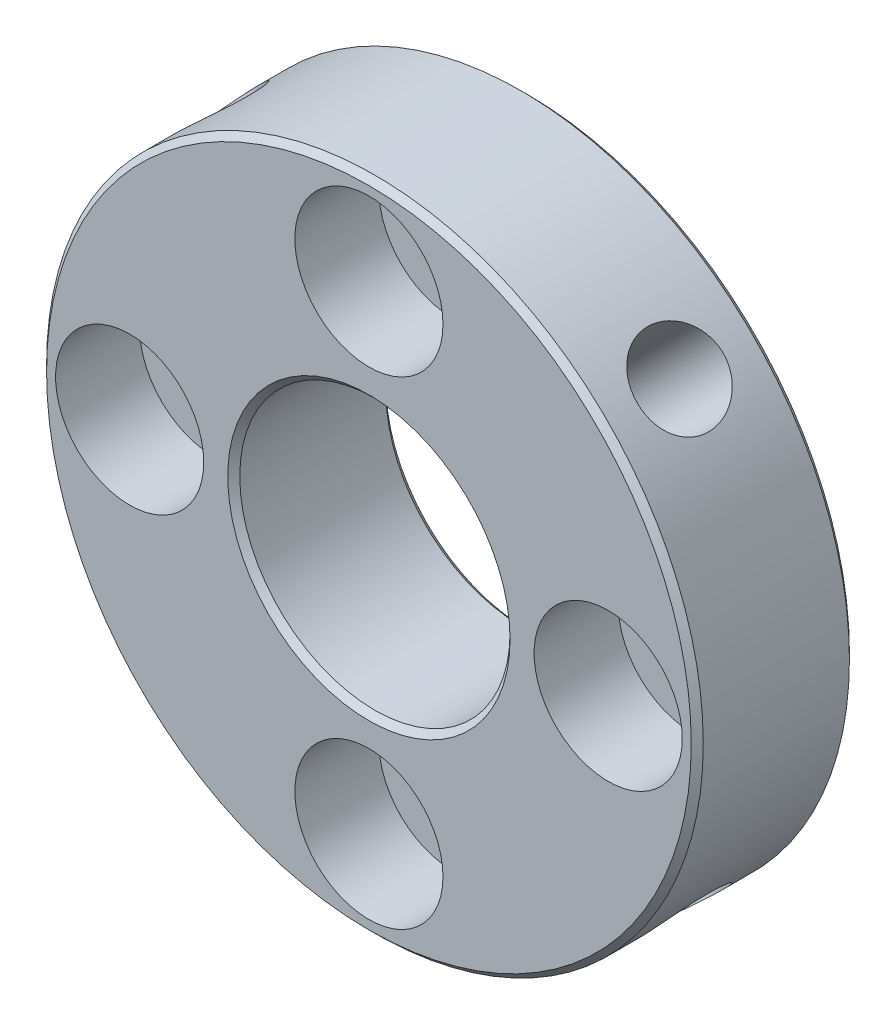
ISO-10303-21;
HEADER;
FILE_DESCRIPTION(('STEP AP214'),'2;1');
FILE_NAME('part.step','',(''),(''),'','','');
FILE_SCHEMA(('AUTOMOTIVE_DESIGN { 1 0 10303 214 1 1 1 1 }'));
ENDSEC;
DATA;
#1=APPLICATION_CONTEXT('core data for automotive mechanical design processes');
#2=APPLICATION_PROTOCOL_DEFINITION('international standard','automotive_design',2000,#1);
#3=PRODUCT_CONTEXT('',#1,'mechanical');
#4=PRODUCT('Part','Part','',(#3));
#5=PRODUCT_RELATED_PRODUCT_CATEGORY('part','',(#4));
#6=PRODUCT_DEFINITION_FORMATION('','',#4);
#7=PRODUCT_DEFINITION_CONTEXT('part definition',#1,'design');
#8=PRODUCT_DEFINITION('design','',#6,#7);
#9=PRODUCT_DEFINITION_SHAPE('','',#8);
#10=(LENGTH_UNIT() NAMED_UNIT(*) SI_UNIT(.MILLI.,.METRE.));
#11=(NAMED_UNIT(*) PLANE_ANGLE_UNIT() SI_UNIT($,.RADIAN.));
#12=(NAMED_UNIT(*) SI_UNIT($,.STERADIAN.) SOLID_ANGLE_UNIT());
#13=UNCERTAINTY_MEASURE_WITH_UNIT(LENGTH_MEASURE(1.E-05),#10,'distance_accuracy_value','');
#14=(GEOMETRIC_REPRESENTATION_CONTEXT(3) GLOBAL_UNCERTAINTY_ASSIGNED_CONTEXT((#13)) GLOBAL_UNIT_ASSIGNED_CONTEXT((#10,
#11,#12)) REPRESENTATION_CONTEXT('',''));
#15=CARTESIAN_POINT('',(0.,0.,0.));
#16=DIRECTION('',(0.,0.,1.));
#17=DIRECTION('',(1.,0.,0.));
#18=AXIS2_PLACEMENT_3D('',#15,#16,#17);
#19=CARTESIAN_POINT('',(0.,0.,-7.90000000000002));
#20=DIRECTION('',(0.,0.,1.));
#21=DIRECTION('',(1.,0.,0.));
#22=AXIS2_PLACEMENT_3D('',#19,#20,#21);
#23=CYLINDRICAL_SURFACE('',#22,16.4);
#24=CARTESIAN_POINT('',(9.97618726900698,13.0167464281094,-3.95000000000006));
#25=CARTESIAN_POINT('',(9.97619213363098,13.0167441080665,-3.82979161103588));
#26=CARTESIAN_POINT('',(9.98429285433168,13.0105465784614,-3.70950930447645));
#27=CARTESIAN_POINT('',(10.0163995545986,12.9858436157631,-3.47229568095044));
#28=CARTESIAN_POINT('',(10.0404219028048,12.9673255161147,-3.35536794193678));
#29=CARTESIAN_POINT('',(10.1034149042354,12.91830444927,-3.12833206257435));
#30=CARTESIAN_POINT('',(10.1423751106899,12.8878098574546,-3.0182192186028));
#31=CARTESIAN_POINT('',(10.2337592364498,12.8153640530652,-2.80781724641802));
#32=CARTESIAN_POINT('',(10.2861809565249,12.7734147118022,-2.70752651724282));
#33=CARTESIAN_POINT('',(10.402904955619,12.6785346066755,-2.51898016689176));
#34=CARTESIAN_POINT('',(10.4672708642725,12.6255448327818,-2.43079362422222));
#35=CARTESIAN_POINT('',(10.6054238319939,12.5097200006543,-2.26955609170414));
#36=CARTESIAN_POINT('',(10.6792113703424,12.4468844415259,-2.19650587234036));
#37=CARTESIAN_POINT('',(10.8339837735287,12.3124054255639,-2.06736504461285));
#38=CARTESIAN_POINT('',(10.9149938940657,12.2407306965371,-2.01133722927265));
#39=CARTESIAN_POINT('',(11.081298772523,12.0903833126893,-1.91823399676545));
#40=CARTESIAN_POINT('',(11.1665933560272,12.0117109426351,-1.88115780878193));
#41=CARTESIAN_POINT('',(11.3382500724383,11.8498066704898,-1.82721743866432));
#42=CARTESIAN_POINT('',(11.4246032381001,11.7666036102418,-1.8102381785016));
#43=CARTESIAN_POINT('',(11.5962451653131,11.5974829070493,-1.7966168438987));
#44=CARTESIAN_POINT('',(11.6815339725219,11.5115653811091,-1.79997389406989));
#45=CARTESIAN_POINT('',(11.8481066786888,11.3400431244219,-1.82683798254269));
#46=CARTESIAN_POINT('',(11.9294119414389,11.2544397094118,-1.85022124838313));
#47=CARTESIAN_POINT('',(12.0864610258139,11.0856105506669,-1.91628033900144));
#48=CARTESIAN_POINT('',(12.1622047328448,11.0023848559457,-1.95895656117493));
#49=CARTESIAN_POINT('',(12.3065447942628,10.8406986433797,-2.06252064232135));
#50=CARTESIAN_POINT('',(12.3751194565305,10.7622528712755,-2.12346173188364));
#51=CARTESIAN_POINT('',(12.5033877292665,10.612963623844,-2.26178690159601));
#52=CARTESIAN_POINT('',(12.5630808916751,10.5421205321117,-2.33917181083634));
#53=CARTESIAN_POINT('',(12.6728219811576,10.4099487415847,-2.50888034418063));
#54=CARTESIAN_POINT('',(12.7227940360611,10.3486955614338,-2.60131188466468));
#55=CARTESIAN_POINT('',(12.8116023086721,10.2385481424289,-2.79812010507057));
#56=CARTESIAN_POINT('',(12.8504384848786,10.1896539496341,-2.90249682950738));
#57=CARTESIAN_POINT('',(12.9163049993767,10.1060335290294,-3.12033160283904));
#58=CARTESIAN_POINT('',(12.9433294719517,10.0713143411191,-3.23379413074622));
#59=CARTESIAN_POINT('',(12.9850738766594,10.0174362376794,-3.46652767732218));
#60=CARTESIAN_POINT('',(12.9997944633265,9.99827649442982,-3.58579838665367));
#61=CARTESIAN_POINT('',(13.016616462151,9.97636649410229,-3.8258155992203));
#62=CARTESIAN_POINT('',(13.018810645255,9.97349560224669,-3.94654459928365));
#63=CARTESIAN_POINT('',(13.0107912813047,9.98395472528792,-4.18688093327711));
#64=CARTESIAN_POINT('',(13.0005780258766,9.99728435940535,-4.30648829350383));
#65=CARTESIAN_POINT('',(12.9679796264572,10.0395320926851,-4.54073045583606));
#66=CARTESIAN_POINT('',(12.9456400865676,10.068391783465,-4.65538216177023));
#67=CARTESIAN_POINT('',(12.8891969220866,10.1405467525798,-4.8769882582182));
#68=CARTESIAN_POINT('',(12.8550928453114,10.1838425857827,-4.98394235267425));
#69=CARTESIAN_POINT('',(12.7754735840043,10.2835476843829,-5.18779849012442));
#70=CARTESIAN_POINT('',(12.7298934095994,10.3400314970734,-5.2846386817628));
#71=CARTESIAN_POINT('',(12.6282396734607,10.4639365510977,-5.46488591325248));
#72=CARTESIAN_POINT('',(12.5721656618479,10.5313582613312,-5.54829237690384));
#73=CARTESIAN_POINT('',(12.4502137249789,10.6752569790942,-5.69983733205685));
#74=CARTESIAN_POINT('',(12.3842763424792,10.7517882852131,-5.76787647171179));
#75=CARTESIAN_POINT('',(12.2442594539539,10.9109729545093,-5.88606687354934));
#76=CARTESIAN_POINT('',(12.1701801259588,10.9936261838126,-5.93621852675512));
#77=CARTESIAN_POINT('',(12.0158396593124,11.1621055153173,-6.01704747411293));
#78=CARTESIAN_POINT('',(11.9355972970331,11.2479215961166,-6.04778147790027));
#79=CARTESIAN_POINT('',(11.7708027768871,11.4202630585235,-6.08908698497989));
#80=CARTESIAN_POINT('',(11.6862508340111,11.5067884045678,-6.0996594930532));
#81=CARTESIAN_POINT('',(11.5158384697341,11.6773236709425,-6.10032181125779));
#82=CARTESIAN_POINT('',(11.429992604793,11.7613475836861,-6.09056454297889));
#83=CARTESIAN_POINT('',(11.2588977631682,11.9252362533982,-6.05116904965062));
#84=CARTESIAN_POINT('',(11.1736487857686,12.0051010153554,-6.0215308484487));
#85=CARTESIAN_POINT('',(11.0064100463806,12.1586112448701,-5.94326429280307));
#86=CARTESIAN_POINT('',(10.9244189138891,12.2322593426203,-5.89464401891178));
#87=CARTESIAN_POINT('',(10.7662742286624,12.3716799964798,-5.77980935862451));
#88=CARTESIAN_POINT('',(10.6901207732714,12.4374524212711,-5.71359467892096));
#89=CARTESIAN_POINT('',(10.5456464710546,12.5601912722,-5.56488775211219));
#90=CARTESIAN_POINT('',(10.4773858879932,12.6170909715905,-5.48228187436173));
#91=CARTESIAN_POINT('',(10.3516923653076,12.7204207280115,-5.30337471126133));
#92=CARTESIAN_POINT('',(10.2942619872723,12.7668483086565,-5.20707019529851));
#93=CARTESIAN_POINT('',(10.1921096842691,12.8485489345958,-5.00302691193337));
#94=CARTESIAN_POINT('',(10.1474427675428,12.8837737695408,-4.8952413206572));
#95=CARTESIAN_POINT('',(10.0728842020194,12.9421507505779,-4.67168342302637));
#96=CARTESIAN_POINT('',(10.0429766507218,12.96531589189,-4.5559198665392));
#97=CARTESIAN_POINT('',(10.006159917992,12.9937330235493,-4.3579785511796));
#98=CARTESIAN_POINT('',(9.99494125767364,13.0023551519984,-4.27704390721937));
#99=CARTESIAN_POINT('',(9.97995330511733,13.0138626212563,-4.11408431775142));
#100=CARTESIAN_POINT('',(9.97618394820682,13.0167480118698,-4.03205938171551));
#101=CARTESIAN_POINT('',(9.97618726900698,13.0167464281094,-3.95000000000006));
#102=B_SPLINE_CURVE_WITH_KNOTS('',3,(#24,#25,#26,#27,#28,#29,#30,#31,#32,#33,#34,#35,#36,#37,
#38,#39,#40,#41,#42,#43,#44,#45,#46,#47,#48,#49,#50,#51,#52,#53,#54,#55,#56,#57,#58,#59,#60,#61,
#62,#63,#64,#65,#66,#67,#68,#69,#70,#71,#72,#73,#74,#75,#76,#77,#78,#79,#80,#81,#82,#83,#84,#85,
#86,#87,#88,#89,#90,#91,#92,#93,#94,#95,#96,#97,#98,#99,#100,#101),.UNSPECIFIED.,.T.,.F.,(4,2,2,
2,2,2,2,2,2,2,2,2,2,2,2,2,2,2,2,2,2,2,2,2,2,2,2,2,2,2,2,2,2,2,2,2,2,2,4),(0.,0.360325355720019,
0.721021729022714,1.08146630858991,1.44185203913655,1.80421582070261,2.16659804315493,
2.53030124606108,2.89398965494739,3.25558529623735,3.61716537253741,3.97652669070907,
4.33589541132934,4.69632182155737,5.05676640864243,5.41992031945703,5.78307558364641,
6.14641098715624,6.50972706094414,6.87034887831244,7.23096221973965,7.59022868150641,
7.94950895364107,8.31087150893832,8.67224955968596,9.03590104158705,9.3995445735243,
9.76212110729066,10.1246795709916,10.4845207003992,10.8443613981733,11.2040490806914,
11.5637427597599,11.9260230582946,12.2883889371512,12.6522937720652,13.0158056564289,
13.2617812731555,13.5077547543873),.UNSPECIFIED.);
#103=CARTESIAN_POINT('',(9.97618726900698,13.0167464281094,-3.95000000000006));
#104=VERTEX_POINT('',#103);
#105=EDGE_CURVE('E10',#104,#104,#102,.T.);
#106=ORIENTED_EDGE('',*,*,#105,.F.);
#107=EDGE_LOOP('',(#106));
#108=FACE_BOUND('',#107,.T.);
#109=CARTESIAN_POINT('',(13.0167464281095,-9.97618726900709,-3.95000000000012));
#110=CARTESIAN_POINT('',(13.0167441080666,-9.97619213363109,-3.82979161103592));
#111=CARTESIAN_POINT('',(13.0105465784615,-9.98429285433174,-3.70950930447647));
#112=CARTESIAN_POINT('',(12.985843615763,-10.0163995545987,-3.47229568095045));
#113=CARTESIAN_POINT('',(12.9673255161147,-10.040421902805,-3.35536794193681));
#114=CARTESIAN_POINT('',(12.91830444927,-10.1034149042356,-3.12833206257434));
#115=CARTESIAN_POINT('',(12.8878098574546,-10.14237511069,-3.01821921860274));
#116=CARTESIAN_POINT('',(12.8153640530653,-10.2337592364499,-2.80781724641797));
#117=CARTESIAN_POINT('',(12.7734147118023,-10.2861809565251,-2.70752651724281));
#118=CARTESIAN_POINT('',(12.6785346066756,-10.4029049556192,-2.51898016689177));
#119=CARTESIAN_POINT('',(12.6255448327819,-10.4672708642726,-2.43079362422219));
#120=CARTESIAN_POINT('',(12.5097200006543,-10.6054238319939,-2.2695560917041));
#121=CARTESIAN_POINT('',(12.4468844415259,-10.6792113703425,-2.19650587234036));
#122=CARTESIAN_POINT('',(12.3124054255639,-10.8339837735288,-2.06736504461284));
#123=CARTESIAN_POINT('',(12.2407306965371,-10.9149938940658,-2.01133722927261));
#124=CARTESIAN_POINT('',(12.0903833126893,-11.0812987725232,-1.91823399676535));
#125=CARTESIAN_POINT('',(12.0117109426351,-11.1665933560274,-1.8811578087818));
#126=CARTESIAN_POINT('',(11.8498066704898,-11.3382500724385,-1.82721743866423));
#127=CARTESIAN_POINT('',(11.7666036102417,-11.4246032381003,-1.81023817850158));
#128=CARTESIAN_POINT('',(11.5974829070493,-11.5962451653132,-1.79661684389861));
#129=CARTESIAN_POINT('',(11.5115653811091,-11.681533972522,-1.79997389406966));
#130=CARTESIAN_POINT('',(11.3400431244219,-11.8481066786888,-1.82683798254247));
#131=CARTESIAN_POINT('',(11.2544397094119,-11.9294119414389,-1.85022124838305));
#132=CARTESIAN_POINT('',(11.0856105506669,-12.086461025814,-1.91628033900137));
#133=CARTESIAN_POINT('',(11.0023848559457,-12.1622047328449,-1.95895656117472));
#134=CARTESIAN_POINT('',(10.8406986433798,-12.3065447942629,-2.06252064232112));
#135=CARTESIAN_POINT('',(10.7622528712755,-12.3751194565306,-2.12346173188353));
#136=CARTESIAN_POINT('',(10.612963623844,-12.5033877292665,-2.26178690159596));
#137=CARTESIAN_POINT('',(10.5421205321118,-12.5630808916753,-2.33917181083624));
#138=CARTESIAN_POINT('',(10.4099487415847,-12.6728219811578,-2.50888034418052));
#139=CARTESIAN_POINT('',(10.3486955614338,-12.7227940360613,-2.60131188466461));
#140=CARTESIAN_POINT('',(10.2385481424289,-12.8116023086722,-2.79812010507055));
#141=CARTESIAN_POINT('',(10.1896539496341,-12.8504384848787,-2.90249682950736));
#142=CARTESIAN_POINT('',(10.1060335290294,-12.9163049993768,-3.12033160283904));
#143=CARTESIAN_POINT('',(10.0713143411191,-12.9433294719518,-3.23379413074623));
#144=CARTESIAN_POINT('',(10.0174362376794,-12.9850738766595,-3.4665276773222));
#145=CARTESIAN_POINT('',(9.99827649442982,-12.9997944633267,-3.58579838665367));
#146=CARTESIAN_POINT('',(9.97636649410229,-13.0166164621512,-3.8258155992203));
#147=CARTESIAN_POINT('',(9.9734956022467,-13.0188106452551,-3.94654459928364));
#148=CARTESIAN_POINT('',(9.98395472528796,-13.0107912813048,-4.18688093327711));
#149=CARTESIAN_POINT('',(9.99728435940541,-13.0005780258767,-4.30648829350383));
#150=CARTESIAN_POINT('',(10.0395320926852,-12.9679796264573,-4.54073045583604));
#151=CARTESIAN_POINT('',(10.0683917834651,-12.9456400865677,-4.65538216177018));
#152=CARTESIAN_POINT('',(10.1405467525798,-12.8891969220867,-4.87698825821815));
#153=CARTESIAN_POINT('',(10.1838425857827,-12.8550928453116,-4.98394235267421));
#154=CARTESIAN_POINT('',(10.2835476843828,-12.7754735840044,-5.18779849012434));
#155=CARTESIAN_POINT('',(10.3400314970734,-12.7298934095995,-5.28463868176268));
#156=CARTESIAN_POINT('',(10.4639365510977,-12.6282396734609,-5.46488591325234));
#157=CARTESIAN_POINT('',(10.5313582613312,-12.5721656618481,-5.54829237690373));
#158=CARTESIAN_POINT('',(10.6752569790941,-12.4502137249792,-5.69983733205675));
#159=CARTESIAN_POINT('',(10.751788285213,-12.3842763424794,-5.76787647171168));
#160=CARTESIAN_POINT('',(10.9109729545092,-12.2442594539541,-5.88606687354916));
#161=CARTESIAN_POINT('',(10.9936261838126,-12.170180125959,-5.93621852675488));
#162=CARTESIAN_POINT('',(11.1621055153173,-12.0158396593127,-6.01704747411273));
#163=CARTESIAN_POINT('',(11.2479215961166,-11.9355972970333,-6.04778147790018));
#164=CARTESIAN_POINT('',(11.4202630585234,-11.7708027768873,-6.08908698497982));
#165=CARTESIAN_POINT('',(11.5067884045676,-11.6862508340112,-6.09965949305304));
#166=CARTESIAN_POINT('',(11.6773236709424,-11.5158384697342,-6.10032181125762));
#167=CARTESIAN_POINT('',(11.7613475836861,-11.4299926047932,-6.09056454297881));
#168=CARTESIAN_POINT('',(11.9252362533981,-11.2588977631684,-6.05116904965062));
#169=CARTESIAN_POINT('',(12.0051010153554,-11.1736487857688,-6.02153084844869));
#170=CARTESIAN_POINT('',(12.1586112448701,-11.0064100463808,-5.94326429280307));
#171=CARTESIAN_POINT('',(12.2322593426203,-10.9244189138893,-5.8946440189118));
#172=CARTESIAN_POINT('',(12.3716799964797,-10.7662742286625,-5.77980935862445));
#173=CARTESIAN_POINT('',(12.4374524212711,-10.6901207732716,-5.71359467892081));
#174=CARTESIAN_POINT('',(12.5601912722,-10.5456464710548,-5.56488775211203));
#175=CARTESIAN_POINT('',(12.6170909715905,-10.4773858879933,-5.48228187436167));
#176=CARTESIAN_POINT('',(12.7204207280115,-10.3516923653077,-5.30337471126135));
#177=CARTESIAN_POINT('',(12.7668483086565,-10.2942619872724,-5.2070701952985));
#178=CARTESIAN_POINT('',(12.8485489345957,-10.1921096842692,-5.00302691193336));
#179=CARTESIAN_POINT('',(12.8837737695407,-10.1474427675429,-4.89524132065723));
#180=CARTESIAN_POINT('',(12.942150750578,-10.0728842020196,-4.6716834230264));
#181=CARTESIAN_POINT('',(12.96531589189,-10.042976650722,-4.55591986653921));
#182=CARTESIAN_POINT('',(12.9937330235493,-10.0061599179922,-4.35797855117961));
#183=CARTESIAN_POINT('',(13.0023551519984,-9.99494125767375,-4.27704390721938));
#184=CARTESIAN_POINT('',(13.0138626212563,-9.97995330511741,-4.11408431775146));
#185=CARTESIAN_POINT('',(13.0167480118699,-9.97618394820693,-4.03205938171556));
#186=CARTESIAN_POINT('',(13.0167464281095,-9.97618726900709,-3.95000000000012));
#187=B_SPLINE_CURVE_WITH_KNOTS('',3,(#109,#110,#111,#112,#113,#114,#115,#116,#117,#118,#119,
#120,#121,#122,#123,#124,#125,#126,#127,#128,#129,#130,#131,#132,#133,#134,#135,#136,#137,#138,
#139,#140,#141,#142,#143,#144,#145,#146,#147,#148,#149,#150,#151,#152,#153,#154,#155,#156,#157,
#158,#159,#160,#161,#162,#163,#164,#165,#166,#167,#168,#169,#170,#171,#172,#173,#174,#175,#176,
#177,#178,#179,#180,#181,#182,#183,#184,#185,#186),.UNSPECIFIED.,.T.,.F.,(4,2,2,2,2,2,2,2,2,2,2,
2,2,2,2,2,2,2,2,2,2,2,2,2,2,2,2,2,2,2,2,2,2,2,2,2,2,2,4),(0.,0.360325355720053,
0.721021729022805,1.08146630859,1.44185203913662,1.80421582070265,2.16659804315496,
2.53030124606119,2.89398965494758,3.25558529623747,3.61716537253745,3.97652669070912,
4.33589541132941,4.69632182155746,5.05676640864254,5.41992031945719,5.78307558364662,
6.14641098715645,6.50972706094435,6.87034887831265,7.23096221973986,7.59022868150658,
7.9495089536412,8.3108715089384,8.67224955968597,9.03590104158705,9.39954457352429,
9.76212110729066,10.1246795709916,10.4845207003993,10.8443613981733,11.2040490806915,
11.56374275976,11.9260230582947,12.2883889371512,12.6522937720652,13.0158056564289,
13.2617812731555,13.5077547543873),.UNSPECIFIED.);
#188=CARTESIAN_POINT('',(13.0167464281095,-9.97618726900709,-3.95000000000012));
#189=VERTEX_POINT('',#188);
#190=EDGE_CURVE('E41',#189,#189,#187,.T.);
#191=ORIENTED_EDGE('',*,*,#190,.F.);
#192=EDGE_LOOP('',(#191));
#193=FACE_BOUND('',#192,.T.);
#194=CARTESIAN_POINT('',(-9.97618726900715,-13.0167464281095,-3.95000000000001));
#195=CARTESIAN_POINT('',(-9.97619213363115,-13.0167441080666,-3.82979161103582));
#196=CARTESIAN_POINT('',(-9.98429285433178,-13.0105465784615,-3.70950930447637));
#197=CARTESIAN_POINT('',(-10.0163995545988,-12.9858436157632,-3.47229568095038));
#198=CARTESIAN_POINT('',(-10.0404219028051,-12.9673255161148,-3.35536794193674));
#199=CARTESIAN_POINT('',(-10.1034149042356,-12.9183044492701,-3.12833206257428));
#200=CARTESIAN_POINT('',(-10.14237511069,-12.8878098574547,-3.01821921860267));
#201=CARTESIAN_POINT('',(-10.2337592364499,-12.8153640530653,-2.80781724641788));
#202=CARTESIAN_POINT('',(-10.2861809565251,-12.7734147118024,-2.70752651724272));
#203=CARTESIAN_POINT('',(-10.4029049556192,-12.6785346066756,-2.51898016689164));
#204=CARTESIAN_POINT('',(-10.4672708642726,-12.625544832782,-2.43079362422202));
#205=CARTESIAN_POINT('',(-10.605423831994,-12.5097200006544,-2.26955609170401));
#206=CARTESIAN_POINT('',(-10.6792113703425,-12.4468844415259,-2.19650587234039));
#207=CARTESIAN_POINT('',(-10.8339837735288,-12.3124054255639,-2.06736504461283));
#208=CARTESIAN_POINT('',(-10.9149938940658,-12.2407306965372,-2.01133722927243));
#209=CARTESIAN_POINT('',(-11.0812987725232,-12.0903833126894,-1.91823399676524));
#210=CARTESIAN_POINT('',(-11.1665933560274,-12.0117109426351,-1.88115780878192));
#211=CARTESIAN_POINT('',(-11.3382500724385,-11.8498066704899,-1.82721743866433));
#212=CARTESIAN_POINT('',(-11.4246032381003,-11.7666036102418,-1.81023817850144));
#213=CARTESIAN_POINT('',(-11.5962451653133,-11.5974829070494,-1.79661684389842));
#214=CARTESIAN_POINT('',(-11.6815339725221,-11.5115653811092,-1.79997389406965));
#215=CARTESIAN_POINT('',(-11.8481066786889,-11.340043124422,-1.82683798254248));
#216=CARTESIAN_POINT('',(-11.929411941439,-11.2544397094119,-1.85022124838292));
#217=CARTESIAN_POINT('',(-12.0864610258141,-11.0856105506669,-1.91628033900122));
#218=CARTESIAN_POINT('',(-12.1622047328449,-11.0023848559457,-1.95895656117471));
#219=CARTESIAN_POINT('',(-12.3065447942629,-10.8406986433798,-2.06252064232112));
#220=CARTESIAN_POINT('',(-12.3751194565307,-10.7622528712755,-2.12346173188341));
#221=CARTESIAN_POINT('',(-12.5033877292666,-10.6129636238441,-2.26178690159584));
#222=CARTESIAN_POINT('',(-12.5630808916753,-10.5421205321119,-2.33917181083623));
#223=CARTESIAN_POINT('',(-12.6728219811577,-10.4099487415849,-2.50888034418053));
#224=CARTESIAN_POINT('',(-12.7227940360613,-10.3486955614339,-2.60131188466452));
#225=CARTESIAN_POINT('',(-12.8116023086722,-10.2385481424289,-2.7981201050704));
#226=CARTESIAN_POINT('',(-12.8504384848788,-10.1896539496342,-2.90249682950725));
#227=CARTESIAN_POINT('',(-12.9163049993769,-10.1060335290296,-3.12033160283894));
#228=CARTESIAN_POINT('',(-12.9433294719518,-10.0713143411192,-3.23379413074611));
#229=CARTESIAN_POINT('',(-12.9850738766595,-10.0174362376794,-3.46652767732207));
#230=CARTESIAN_POINT('',(-12.9997944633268,-9.99827649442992,-3.58579838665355));
#231=CARTESIAN_POINT('',(-13.0166164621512,-9.97636649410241,-3.82581559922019));
#232=CARTESIAN_POINT('',(-13.0188106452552,-9.97349560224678,-3.94654459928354));
#233=CARTESIAN_POINT('',(-13.0107912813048,-9.98395472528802,-4.186880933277));
#234=CARTESIAN_POINT('',(-13.0005780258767,-9.99728435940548,-4.30648829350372));
#235=CARTESIAN_POINT('',(-12.9679796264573,-10.0395320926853,-4.54073045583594));
#236=CARTESIAN_POINT('',(-12.9456400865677,-10.0683917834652,-4.65538216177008));
#237=CARTESIAN_POINT('',(-12.8891969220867,-10.1405467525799,-4.87698825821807));
#238=CARTESIAN_POINT('',(-12.8550928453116,-10.1838425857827,-4.98394235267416));
#239=CARTESIAN_POINT('',(-12.7754735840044,-10.2835476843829,-5.18779849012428));
#240=CARTESIAN_POINT('',(-12.7298934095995,-10.3400314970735,-5.28463868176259));
#241=CARTESIAN_POINT('',(-12.6282396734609,-10.4639365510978,-5.46488591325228));
#242=CARTESIAN_POINT('',(-12.5721656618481,-10.5313582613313,-5.54829237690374));
#243=CARTESIAN_POINT('',(-12.4502137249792,-10.6752569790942,-5.69983733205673));
#244=CARTESIAN_POINT('',(-12.3842763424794,-10.7517882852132,-5.76787647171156));
#245=CARTESIAN_POINT('',(-12.2442594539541,-10.9109729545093,-5.88606687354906));
#246=CARTESIAN_POINT('',(-12.170180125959,-10.9936261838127,-5.93621852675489));
#247=CARTESIAN_POINT('',(-12.0158396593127,-11.1621055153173,-6.01704747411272));
#248=CARTESIAN_POINT('',(-11.9355972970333,-11.2479215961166,-6.04778147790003));
#249=CARTESIAN_POINT('',(-11.7708027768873,-11.4202630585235,-6.08908698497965));
#250=CARTESIAN_POINT('',(-11.6862508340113,-11.5067884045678,-6.09965949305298));
#251=CARTESIAN_POINT('',(-11.5158384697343,-11.6773236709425,-6.10032181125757));
#252=CARTESIAN_POINT('',(-11.4299926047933,-11.7613475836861,-6.09056454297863));
#253=CARTESIAN_POINT('',(-11.2588977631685,-11.9252362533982,-6.05116904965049));
#254=CARTESIAN_POINT('',(-11.1736487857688,-12.0051010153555,-6.02153084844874));
#255=CARTESIAN_POINT('',(-11.0064100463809,-12.1586112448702,-5.94326429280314));
#256=CARTESIAN_POINT('',(-10.9244189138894,-12.2322593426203,-5.8946440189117));
#257=CARTESIAN_POINT('',(-10.7662742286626,-12.3716799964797,-5.77980935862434));
#258=CARTESIAN_POINT('',(-10.6901207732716,-12.4374524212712,-5.71359467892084));
#259=CARTESIAN_POINT('',(-10.5456464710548,-12.5601912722,-5.56488775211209));
#260=CARTESIAN_POINT('',(-10.4773858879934,-12.6170909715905,-5.48228187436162));
#261=CARTESIAN_POINT('',(-10.3516923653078,-12.7204207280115,-5.30337471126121));
#262=CARTESIAN_POINT('',(-10.2942619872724,-12.7668483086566,-5.2070701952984));
#263=CARTESIAN_POINT('',(-10.1921096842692,-12.8485489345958,-5.00302691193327));
#264=CARTESIAN_POINT('',(-10.147442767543,-12.8837737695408,-4.89524132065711));
#265=CARTESIAN_POINT('',(-10.0728842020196,-12.942150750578,-4.6716834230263));
#266=CARTESIAN_POINT('',(-10.042976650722,-12.9653158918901,-4.55591986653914));
#267=CARTESIAN_POINT('',(-10.0061599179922,-12.9937330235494,-4.35797855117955));
#268=CARTESIAN_POINT('',(-9.99494125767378,-13.0023551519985,-4.27704390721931));
#269=CARTESIAN_POINT('',(-9.97995330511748,-13.0138626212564,-4.11408431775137));
#270=CARTESIAN_POINT('',(-9.97618394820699,-13.0167480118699,-4.03205938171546));
#271=CARTESIAN_POINT('',(-9.97618726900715,-13.0167464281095,-3.95000000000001));
#272=B_SPLINE_CURVE_WITH_KNOTS('',3,(#194,#195,#196,#197,#198,#199,#200,#201,#202,#203,#204,
#205,#206,#207,#208,#209,#210,#211,#212,#213,#214,#215,#216,#217,#218,#219,#220,#221,#222,#223,
#224,#225,#226,#227,#228,#229,#230,#231,#232,#233,#234,#235,#236,#237,#238,#239,#240,#241,#242,
#243,#244,#245,#246,#247,#248,#249,#250,#251,#252,#253,#254,#255,#256,#257,#258,#259,#260,#261,
#262,#263,#264,#265,#266,#267,#268,#269,#270,#271),.UNSPECIFIED.,.T.,.F.,(4,2,2,2,2,2,2,2,2,2,2,
2,2,2,2,2,2,2,2,2,2,2,2,2,2,2,2,2,2,2,2,2,2,2,2,2,2,2,4),(0.,0.360325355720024,
0.721021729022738,1.08146630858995,1.4418520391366,1.80421582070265,2.16659804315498,
2.53030124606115,2.89398965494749,3.25558529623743,3.61716537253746,3.97652669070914,
4.33589541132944,4.69632182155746,5.05676640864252,5.41992031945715,5.78307558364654,
6.14641098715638,6.50972706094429,6.87034887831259,7.2309622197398,7.59022868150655,
7.94950895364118,8.3108715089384,8.672249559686,9.03590104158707,9.39954457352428,
9.76212110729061,10.1246795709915,10.4845207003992,10.8443613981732,11.2040490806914,
11.5637427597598,11.9260230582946,12.2883889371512,12.6522937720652,13.0158056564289,
13.2617812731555,13.5077547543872),.UNSPECIFIED.);
#273=CARTESIAN_POINT('',(-9.97618726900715,-13.0167464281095,-3.95000000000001));
#274=VERTEX_POINT('',#273);
#275=EDGE_CURVE('E45',#274,#274,#272,.T.);
#276=ORIENTED_EDGE('',*,*,#275,.F.);
#277=EDGE_LOOP('',(#276));
#278=FACE_BOUND('',#277,.T.);
#279=CARTESIAN_POINT('',(-13.0167464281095,9.97618726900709,-3.95000000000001));
#280=CARTESIAN_POINT('',(-13.0167441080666,9.97619213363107,-3.82979161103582));
#281=CARTESIAN_POINT('',(-13.0105465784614,9.98429285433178,-3.70950930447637));
#282=CARTESIAN_POINT('',(-12.9858436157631,10.0163995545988,-3.47229568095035));
#283=CARTESIAN_POINT('',(-12.9673255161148,10.040421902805,-3.35536794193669));
#284=CARTESIAN_POINT('',(-12.9183044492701,10.1034149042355,-3.12833206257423));
#285=CARTESIAN_POINT('',(-12.8878098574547,10.14237511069,-3.01821921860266));
#286=CARTESIAN_POINT('',(-12.8153640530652,10.2337592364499,-2.8078172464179));
#287=CARTESIAN_POINT('',(-12.7734147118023,10.2861809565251,-2.70752651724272));
#288=CARTESIAN_POINT('',(-12.6785346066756,10.4029049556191,-2.51898016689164));
#289=CARTESIAN_POINT('',(-12.6255448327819,10.4672708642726,-2.43079362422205));
#290=CARTESIAN_POINT('',(-12.5097200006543,10.6054238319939,-2.26955609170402));
#291=CARTESIAN_POINT('',(-12.4468844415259,10.6792113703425,-2.19650587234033));
#292=CARTESIAN_POINT('',(-12.3124054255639,10.8339837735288,-2.06736504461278));
#293=CARTESIAN_POINT('',(-12.2407306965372,10.9149938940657,-2.01133722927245));
#294=CARTESIAN_POINT('',(-12.0903833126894,11.0812987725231,-1.91823399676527));
#295=CARTESIAN_POINT('',(-12.011710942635,11.1665933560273,-1.88115780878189));
#296=CARTESIAN_POINT('',(-11.8498066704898,11.3382500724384,-1.82721743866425));
#297=CARTESIAN_POINT('',(-11.7666036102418,11.4246032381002,-1.81023817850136));
#298=CARTESIAN_POINT('',(-11.5974829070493,11.5962451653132,-1.7966168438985));
#299=CARTESIAN_POINT('',(-11.5115653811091,11.681533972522,-1.79997389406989));
#300=CARTESIAN_POINT('',(-11.3400431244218,11.8481066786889,-1.82683798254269));
#301=CARTESIAN_POINT('',(-11.2544397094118,11.929411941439,-1.85022124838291));
#302=CARTESIAN_POINT('',(-11.0856105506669,12.0864610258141,-1.91628033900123));
#303=CARTESIAN_POINT('',(-11.0023848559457,12.1622047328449,-1.95895656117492));
#304=CARTESIAN_POINT('',(-10.8406986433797,12.3065447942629,-2.06252064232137));
#305=CARTESIAN_POINT('',(-10.7622528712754,12.3751194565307,-2.12346173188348));
#306=CARTESIAN_POINT('',(-10.6129636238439,12.5033877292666,-2.26178690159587));
#307=CARTESIAN_POINT('',(-10.5421205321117,12.5630808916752,-2.33917181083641));
#308=CARTESIAN_POINT('',(-10.4099487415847,12.6728219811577,-2.50888034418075));
#309=CARTESIAN_POINT('',(-10.3486955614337,12.7227940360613,-2.60131188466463));
#310=CARTESIAN_POINT('',(-10.2385481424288,12.8116023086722,-2.79812010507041));
#311=CARTESIAN_POINT('',(-10.1896539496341,12.8504384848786,-2.90249682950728));
#312=CARTESIAN_POINT('',(-10.1060335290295,12.9163049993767,-3.12033160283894));
#313=CARTESIAN_POINT('',(-10.071314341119,12.9433294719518,-3.23379413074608));
#314=CARTESIAN_POINT('',(-10.0174362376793,12.9850738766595,-3.46652767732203));
#315=CARTESIAN_POINT('',(-9.99827649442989,12.9997944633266,-3.58579838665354));
#316=CARTESIAN_POINT('',(-9.97636649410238,13.016616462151,-3.8258155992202));
#317=CARTESIAN_POINT('',(-9.97349560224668,13.0188106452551,-3.94654459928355));
#318=CARTESIAN_POINT('',(-9.98395472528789,13.0107912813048,-4.18688093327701));
#319=CARTESIAN_POINT('',(-9.99728435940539,13.0005780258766,-4.30648829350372));
#320=CARTESIAN_POINT('',(-10.0395320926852,12.9679796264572,-4.54073045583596));
#321=CARTESIAN_POINT('',(-10.0683917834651,12.9456400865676,-4.65538216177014));
#322=CARTESIAN_POINT('',(-10.1405467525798,12.8891969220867,-4.87698825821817));
#323=CARTESIAN_POINT('',(-10.1838425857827,12.8550928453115,-4.98394235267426));
#324=CARTESIAN_POINT('',(-10.2835476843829,12.7754735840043,-5.1877984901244));
#325=CARTESIAN_POINT('',(-10.3400314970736,12.7298934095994,-5.2846386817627));
#326=CARTESIAN_POINT('',(-10.4639365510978,12.6282396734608,-5.46488591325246));
#327=CARTESIAN_POINT('',(-10.5313582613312,12.572165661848,-5.54829237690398));
#328=CARTESIAN_POINT('',(-10.6752569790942,12.4502137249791,-5.69983733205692));
#329=CARTESIAN_POINT('',(-10.7517882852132,12.3842763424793,-5.76787647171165));
#330=CARTESIAN_POINT('',(-10.9109729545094,12.2442594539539,-5.88606687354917));
#331=CARTESIAN_POINT('',(-10.9936261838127,12.1701801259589,-5.93621852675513));
#332=CARTESIAN_POINT('',(-11.1621055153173,12.0158396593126,-6.01704747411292));
#333=CARTESIAN_POINT('',(-11.2479215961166,11.9355972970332,-6.04778147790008));
#334=CARTESIAN_POINT('',(-11.4202630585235,11.7708027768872,-6.08908698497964));
#335=CARTESIAN_POINT('',(-11.5067884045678,11.6862508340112,-6.09965949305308));
#336=CARTESIAN_POINT('',(-11.6773236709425,11.5158384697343,-6.10032181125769));
#337=CARTESIAN_POINT('',(-11.7613475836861,11.4299926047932,-6.09056454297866));
#338=CARTESIAN_POINT('',(-11.9252362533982,11.2588977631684,-6.05116904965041));
#339=CARTESIAN_POINT('',(-12.0051010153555,11.1736487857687,-6.02153084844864));
#340=CARTESIAN_POINT('',(-12.1586112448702,11.0064100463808,-5.94326429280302));
#341=CARTESIAN_POINT('',(-12.2322593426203,10.9244189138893,-5.89464401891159));
#342=CARTESIAN_POINT('',(-12.3716799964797,10.7662742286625,-5.77980935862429));
#343=CARTESIAN_POINT('',(-12.4374524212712,10.6901207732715,-5.71359467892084));
#344=CARTESIAN_POINT('',(-12.5601912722,10.5456464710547,-5.56488775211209));
#345=CARTESIAN_POINT('',(-12.6170909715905,10.4773858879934,-5.48228187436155));
#346=CARTESIAN_POINT('',(-12.7204207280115,10.3516923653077,-5.30337471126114));
#347=CARTESIAN_POINT('',(-12.7668483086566,10.2942619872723,-5.20707019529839));
#348=CARTESIAN_POINT('',(-12.8485489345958,10.1921096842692,-5.00302691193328));
#349=CARTESIAN_POINT('',(-12.8837737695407,10.147442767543,-4.89524132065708));
#350=CARTESIAN_POINT('',(-12.9421507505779,10.0728842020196,-4.67168342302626));
#351=CARTESIAN_POINT('',(-12.96531589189,10.0429766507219,-4.55591986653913));
#352=CARTESIAN_POINT('',(-12.9937330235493,10.0061599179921,-4.35797855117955));
#353=CARTESIAN_POINT('',(-13.0023551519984,9.99494125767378,-4.27704390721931));
#354=CARTESIAN_POINT('',(-13.0138626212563,9.97995330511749,-4.11408431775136));
#355=CARTESIAN_POINT('',(-13.0167480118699,9.97618394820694,-4.03205938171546));
#356=CARTESIAN_POINT('',(-13.0167464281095,9.97618726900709,-3.95000000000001));
#357=B_SPLINE_CURVE_WITH_KNOTS('',3,(#279,#280,#281,#282,#283,#284,#285,#286,#287,#288,#289,
#290,#291,#292,#293,#294,#295,#296,#297,#298,#299,#300,#301,#302,#303,#304,#305,#306,#307,#308,
#309,#310,#311,#312,#313,#314,#315,#316,#317,#318,#319,#320,#321,#322,#323,#324,#325,#326,#327,
#328,#329,#330,#331,#332,#333,#334,#335,#336,#337,#338,#339,#340,#341,#342,#343,#344,#345,#346,
#347,#348,#349,#350,#351,#352,#353,#354,#355,#356),.UNSPECIFIED.,.T.,.F.,(4,2,2,2,2,2,2,2,2,2,2,
2,2,2,2,2,2,2,2,2,2,2,2,2,2,2,2,2,2,2,2,2,2,2,2,2,2,2,4),(0.,0.360325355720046,
0.721021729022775,1.08146630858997,1.4418520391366,1.80421582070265,2.16659804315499,
2.53030124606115,2.89398965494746,3.25558529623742,3.61716537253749,3.97652669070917,
4.33589541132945,4.69632182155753,5.05676640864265,5.41992031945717,5.78307558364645,
6.14641098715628,6.5097270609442,6.87034887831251,7.23096221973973,7.59022868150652,
7.94950895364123,8.31087150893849,8.67224955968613,9.03590104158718,9.3995445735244,
9.7621211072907,10.1246795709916,10.4845207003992,10.8443613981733,11.2040490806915,
11.5637427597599,11.9260230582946,12.2883889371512,12.6522937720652,13.0158056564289,
13.2617812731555,13.5077547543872),.UNSPECIFIED.);
#358=CARTESIAN_POINT('',(-13.0167464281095,9.97618726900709,-3.95000000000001));
#359=VERTEX_POINT('',#358);
#360=EDGE_CURVE('E49',#359,#359,#357,.T.);
#361=ORIENTED_EDGE('',*,*,#360,.F.);
#362=EDGE_LOOP('',(#361));
#363=FACE_BOUND('',#362,.T.);
#364=CARTESIAN_POINT('',(0.,0.,-7.6));
#365=DIRECTION('',(0.,0.,0.999999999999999));
#366=DIRECTION('',(1.,0.,0.));
#367=AXIS2_PLACEMENT_3D('',#364,#365,#366);
#368=CIRCLE('',#367,16.4);
#369=CARTESIAN_POINT('',(16.3999999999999,0.,-7.6));
#370=VERTEX_POINT('',#369);
#371=EDGE_CURVE('E96',#370,#370,#368,.T.);
#372=ORIENTED_EDGE('',*,*,#371,.T.);
#373=EDGE_LOOP('',(#372));
#374=FACE_BOUND('',#373,.T.);
#375=CARTESIAN_POINT('',(0.,0.,-0.300000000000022));
#376=DIRECTION('',(0.,0.,0.999999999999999));
#377=DIRECTION('',(1.,0.,0.));
#378=AXIS2_PLACEMENT_3D('',#375,#376,#377);
#379=CIRCLE('',#378,16.4);
#380=CARTESIAN_POINT('',(-16.4,0.,-0.300000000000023));
#381=VERTEX_POINT('',#380);
#382=EDGE_CURVE('E99',#381,#381,#379,.F.);
#383=ORIENTED_EDGE('',*,*,#382,.T.);
#384=EDGE_LOOP('',(#383));
#385=FACE_BOUND('',#384,.T.);
#386=ADVANCED_FACE('F30',(#108,#193,#278,#363,#374,#385),#23,.T.);
#387=CARTESIAN_POINT('',(0.,0.,-7.90000000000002));
#388=DIRECTION('',(0.,0.,1.));
#389=DIRECTION('',(1.,0.,0.));
#390=AXIS2_PLACEMENT_3D('',#387,#388,#389);
#391=PLANE('',#390);
#392=CARTESIAN_POINT('',(11.9499999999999,0.,-7.90000000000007));
#393=DIRECTION('',(0.,0.,1.));
#394=DIRECTION('',(1.,0.,0.));
#395=AXIS2_PLACEMENT_3D('',#392,#393,#394);
#396=CIRCLE('',#395,2.15);
#397=CARTESIAN_POINT('',(14.0999999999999,0.,-7.90000000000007));
#398=VERTEX_POINT('',#397);
#399=EDGE_CURVE('E156',#398,#398,#396,.F.);
#400=ORIENTED_EDGE('',*,*,#399,.F.);
#401=EDGE_LOOP('',(#400));
#402=FACE_BOUND('',#401,.T.);
#403=CARTESIAN_POINT('',(0.,-11.9500000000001,-7.89999999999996));
#404=DIRECTION('',(0.,0.,1.));
#405=DIRECTION('',(1.,0.,0.));
#406=AXIS2_PLACEMENT_3D('',#403,#404,#405);
#407=CIRCLE('',#406,2.15);
#408=CARTESIAN_POINT('',(2.15000000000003,-11.9500000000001,-7.89999999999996));
#409=VERTEX_POINT('',#408);
#410=EDGE_CURVE('E150',#409,#409,#407,.F.);
#411=ORIENTED_EDGE('',*,*,#410,.F.);
#412=EDGE_LOOP('',(#411));
#413=FACE_BOUND('',#412,.T.);
#414=CARTESIAN_POINT('',(-11.95,-1.38777878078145E-13,-7.90000000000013));
#415=DIRECTION('',(0.,0.,1.));
#416=DIRECTION('',(1.,0.,0.));
#417=AXIS2_PLACEMENT_3D('',#414,#415,#416);
#418=CIRCLE('',#417,2.15);
#419=CARTESIAN_POINT('',(-9.80000000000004,-1.38777878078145E-13,-7.90000000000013));
#420=VERTEX_POINT('',#419);
#421=EDGE_CURVE('E142',#420,#420,#418,.F.);
#422=ORIENTED_EDGE('',*,*,#421,.F.);
#423=EDGE_LOOP('',(#422));
#424=FACE_BOUND('',#423,.T.);
#425=CARTESIAN_POINT('',(0.,11.9499999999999,-7.90000000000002));
#426=DIRECTION('',(0.,0.,1.));
#427=DIRECTION('',(1.,0.,0.));
#428=AXIS2_PLACEMENT_3D('',#425,#426,#427);
#429=CIRCLE('',#428,2.15);
#430=CARTESIAN_POINT('',(2.14999999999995,11.9499999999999,-7.90000000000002));
#431=VERTEX_POINT('',#430);
#432=EDGE_CURVE('E118',#431,#431,#429,.F.);
#433=ORIENTED_EDGE('',*,*,#432,.F.);
#434=EDGE_LOOP('',(#433));
#435=FACE_BOUND('',#434,.T.);
#436=CARTESIAN_POINT('',(0.,0.,-7.90000000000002));
#437=DIRECTION('',(0.,0.,1.));
#438=DIRECTION('',(1.,0.,0.));
#439=AXIS2_PLACEMENT_3D('',#436,#437,#438);
#440=CIRCLE('',#439,7.04999999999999);
#441=CARTESIAN_POINT('',(7.04999999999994,0.,-7.90000000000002));
#442=VERTEX_POINT('',#441);
#443=EDGE_CURVE('E102',#442,#442,#440,.T.);
#444=ORIENTED_EDGE('',*,*,#443,.T.);
#445=EDGE_LOOP('',(#444));
#446=FACE_BOUND('',#445,.T.);
#447=CARTESIAN_POINT('',(0.,0.,-7.90000000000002));
#448=DIRECTION('',(0.,0.,1.));
#449=DIRECTION('',(1.,0.,0.));
#450=AXIS2_PLACEMENT_3D('',#447,#448,#449);
#451=CIRCLE('',#450,16.1);
#452=CARTESIAN_POINT('',(16.0999999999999,0.,-7.90000000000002));
#453=VERTEX_POINT('',#452);
#454=EDGE_CURVE('E105',#453,#453,#451,.F.);
#455=ORIENTED_EDGE('',*,*,#454,.T.);
#456=EDGE_LOOP('',(#455));
#457=FACE_BOUND('',#456,.T.);
#458=ADVANCED_FACE('F187',(#402,#413,#424,#435,#446,#457),#391,.F.);
#459=CARTESIAN_POINT('',(0.,0.,0.));
#460=DIRECTION('',(0.,0.,1.));
#461=DIRECTION('',(1.,0.,0.));
#462=AXIS2_PLACEMENT_3D('',#459,#460,#461);
#463=PLANE('',#462);
#464=CARTESIAN_POINT('',(11.95,0.,-1.11022302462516E-13));
#465=DIRECTION('',(0.,0.,1.));
#466=DIRECTION('',(0.,-1.,0.));
#467=AXIS2_PLACEMENT_3D('',#464,#465,#466);
#468=CIRCLE('',#467,3.7);
#469=CARTESIAN_POINT('',(15.65,0.,-1.11022302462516E-13));
#470=VERTEX_POINT('',#469);
#471=EDGE_CURVE('E139',#470,#470,#468,.T.);
#472=ORIENTED_EDGE('',*,*,#471,.F.);
#473=EDGE_LOOP('',(#472));
#474=FACE_BOUND('',#473,.T.);
#475=CARTESIAN_POINT('',(0.,-11.95,0.));
#476=DIRECTION('',(0.,0.,1.));
#477=DIRECTION('',(-1.,0.,0.));
#478=AXIS2_PLACEMENT_3D('',#475,#476,#477);
#479=CIRCLE('',#478,3.7);
#480=CARTESIAN_POINT('',(3.70000000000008,-11.9500000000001,0.));
#481=VERTEX_POINT('',#480);
#482=EDGE_CURVE('E133',#481,#481,#479,.T.);
#483=ORIENTED_EDGE('',*,*,#482,.F.);
#484=EDGE_LOOP('',(#483));
#485=FACE_BOUND('',#484,.T.);
#486=CARTESIAN_POINT('',(-11.95,-1.11022302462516E-13,-1.11022302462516E-13));
#487=DIRECTION('',(0.,0.,1.));
#488=DIRECTION('',(0.,1.,0.));
#489=AXIS2_PLACEMENT_3D('',#486,#487,#488);
#490=CIRCLE('',#489,3.7);
#491=CARTESIAN_POINT('',(-8.24999999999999,0.,-1.11022302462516E-13));
#492=VERTEX_POINT('',#491);
#493=EDGE_CURVE('E127',#492,#492,#490,.T.);
#494=ORIENTED_EDGE('',*,*,#493,.F.);
#495=EDGE_LOOP('',(#494));
#496=FACE_BOUND('',#495,.T.);
#497=CARTESIAN_POINT('',(0.,11.9499999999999,0.));
#498=DIRECTION('',(0.,0.,1.));
#499=DIRECTION('',(1.,0.,0.));
#500=AXIS2_PLACEMENT_3D('',#497,#498,#499);
#501=CIRCLE('',#500,3.7);
#502=CARTESIAN_POINT('',(3.69999999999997,11.9499999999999,0.));
#503=VERTEX_POINT('',#502);
#504=EDGE_CURVE('E115',#503,#503,#501,.T.);
#505=ORIENTED_EDGE('',*,*,#504,.F.);
#506=EDGE_LOOP('',(#505));
#507=FACE_BOUND('',#506,.T.);
#508=CARTESIAN_POINT('',(0.,0.,0.));
#509=DIRECTION('',(0.,0.,1.));
#510=DIRECTION('',(1.,0.,0.));
#511=AXIS2_PLACEMENT_3D('',#508,#509,#510);
#512=CIRCLE('',#511,16.1);
#513=CARTESIAN_POINT('',(-16.1,0.,0.));
#514=VERTEX_POINT('',#513);
#515=EDGE_CURVE('E90',#514,#514,#512,.T.);
#516=ORIENTED_EDGE('',*,*,#515,.T.);
#517=EDGE_LOOP('',(#516));
#518=FACE_BOUND('',#517,.T.);
#519=CARTESIAN_POINT('',(0.,0.,0.));
#520=DIRECTION('',(0.,0.,1.));
#521=DIRECTION('',(1.,0.,0.));
#522=AXIS2_PLACEMENT_3D('',#519,#520,#521);
#523=CIRCLE('',#522,7.05000000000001);
#524=CARTESIAN_POINT('',(7.04999999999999,0.,0.));
#525=VERTEX_POINT('',#524);
#526=EDGE_CURVE('E93',#525,#525,#523,.F.);
#527=ORIENTED_EDGE('',*,*,#526,.T.);
#528=EDGE_LOOP('',(#527));
#529=FACE_BOUND('',#528,.T.);
#530=ADVANCED_FACE('F192',(#474,#485,#496,#507,#518,#529),#463,.T.);
#531=CARTESIAN_POINT('',(0.,0.,-7.90099999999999));
#532=DIRECTION('',(0.,0.,1.));
#533=DIRECTION('',(1.,0.,0.));
#534=AXIS2_PLACEMENT_3D('',#531,#532,#533);
#535=CYLINDRICAL_SURFACE('',#534,6.75);
#536=CARTESIAN_POINT('',(0.,0.,-7.6));
#537=DIRECTION('',(0.,0.,1.));
#538=DIRECTION('',(1.,0.,0.));
#539=AXIS2_PLACEMENT_3D('',#536,#537,#538);
#540=CIRCLE('',#539,6.75);
#541=CARTESIAN_POINT('',(6.74999999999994,0.,-7.6));
#542=VERTEX_POINT('',#541);
#543=EDGE_CURVE('E108',#542,#542,#540,.F.);
#544=CARTESIAN_POINT('',(0.,0.,-0.300000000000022));
#545=DIRECTION('',(0.,0.,1.));
#546=DIRECTION('',(1.,0.,0.));
#547=AXIS2_PLACEMENT_3D('',#544,#545,#546);
#548=CIRCLE('',#547,6.75);
#549=CARTESIAN_POINT('',(6.74999999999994,0.,-0.300000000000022));
#550=VERTEX_POINT('',#549);
#551=EDGE_CURVE('E111',#550,#550,#548,.T.);
#552=CARTESIAN_POINT('',(6.74999999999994,0.,-7.6));
#553=CARTESIAN_POINT('',(6.74999999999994,0.,-7.52395833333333));
#554=CARTESIAN_POINT('',(6.74999999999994,0.,-7.44791666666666));
#555=CARTESIAN_POINT('',(6.74999999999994,0.,-7.29583333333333));
#556=CARTESIAN_POINT('',(6.74999999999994,0.,-7.21979166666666));
#557=CARTESIAN_POINT('',(6.74999999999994,0.,-7.06770833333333));
#558=CARTESIAN_POINT('',(6.74999999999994,0.,-6.99166666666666));
#559=CARTESIAN_POINT('',(6.74999999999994,0.,-6.83958333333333));
#560=CARTESIAN_POINT('',(6.74999999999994,0.,-6.76354166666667));
#561=CARTESIAN_POINT('',(6.74999999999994,0.,-6.61145833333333));
#562=CARTESIAN_POINT('',(6.74999999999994,0.,-6.53541666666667));
#563=CARTESIAN_POINT('',(6.74999999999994,0.,-6.38333333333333));
#564=CARTESIAN_POINT('',(6.74999999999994,0.,-6.30729166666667));
#565=CARTESIAN_POINT('',(6.74999999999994,0.,-6.15520833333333));
#566=CARTESIAN_POINT('',(6.74999999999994,0.,-6.07916666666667));
#567=CARTESIAN_POINT('',(6.74999999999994,0.,-5.92708333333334));
#568=CARTESIAN_POINT('',(6.74999999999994,0.,-5.85104166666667));
#569=CARTESIAN_POINT('',(6.74999999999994,0.,-5.69895833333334));
#570=CARTESIAN_POINT('',(6.74999999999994,0.,-5.62291666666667));
#571=CARTESIAN_POINT('',(6.74999999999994,0.,-5.47083333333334));
#572=CARTESIAN_POINT('',(6.74999999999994,0.,-5.39479166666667));
#573=CARTESIAN_POINT('',(6.74999999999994,0.,-5.24270833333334));
#574=CARTESIAN_POINT('',(6.74999999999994,0.,-5.16666666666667));
#575=CARTESIAN_POINT('',(6.74999999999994,0.,-5.01458333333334));
#576=CARTESIAN_POINT('',(6.74999999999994,0.,-4.93854166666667));
#577=CARTESIAN_POINT('',(6.74999999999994,0.,-4.78645833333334));
#578=CARTESIAN_POINT('',(6.74999999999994,0.,-4.71041666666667));
#579=CARTESIAN_POINT('',(6.74999999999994,0.,-4.55833333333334));
#580=CARTESIAN_POINT('',(6.74999999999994,0.,-4.48229166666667));
#581=CARTESIAN_POINT('',(6.74999999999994,0.,-4.33020833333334));
#582=CARTESIAN_POINT('',(6.74999999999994,0.,-4.25416666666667));
#583=CARTESIAN_POINT('',(6.74999999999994,0.,-4.10208333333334));
#584=CARTESIAN_POINT('',(6.74999999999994,0.,-4.02604166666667));
#585=CARTESIAN_POINT('',(6.74999999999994,0.,-3.87395833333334));
#586=CARTESIAN_POINT('',(6.74999999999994,0.,-3.79791666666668));
#587=CARTESIAN_POINT('',(6.74999999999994,0.,-3.64583333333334));
#588=CARTESIAN_POINT('',(6.74999999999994,0.,-3.56979166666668));
#589=CARTESIAN_POINT('',(6.74999999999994,0.,-3.41770833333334));
#590=CARTESIAN_POINT('',(6.74999999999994,0.,-3.34166666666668));
#591=CARTESIAN_POINT('',(6.74999999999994,0.,-3.18958333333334));
#592=CARTESIAN_POINT('',(6.74999999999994,0.,-3.11354166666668));
#593=CARTESIAN_POINT('',(6.74999999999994,0.,-2.96145833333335));
#594=CARTESIAN_POINT('',(6.74999999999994,0.,-2.88541666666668));
#595=CARTESIAN_POINT('',(6.74999999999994,0.,-2.73333333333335));
#596=CARTESIAN_POINT('',(6.74999999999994,0.,-2.65729166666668));
#597=CARTESIAN_POINT('',(6.74999999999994,0.,-2.50520833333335));
#598=CARTESIAN_POINT('',(6.74999999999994,0.,-2.42916666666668));
#599=CARTESIAN_POINT('',(6.74999999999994,0.,-2.27708333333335));
#600=CARTESIAN_POINT('',(6.74999999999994,0.,-2.20104166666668));
#601=CARTESIAN_POINT('',(6.74999999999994,0.,-2.04895833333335));
#602=CARTESIAN_POINT('',(6.74999999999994,0.,-1.97291666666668));
#603=CARTESIAN_POINT('',(6.74999999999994,0.,-1.82083333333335));
#604=CARTESIAN_POINT('',(6.74999999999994,0.,-1.74479166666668));
#605=CARTESIAN_POINT('',(6.74999999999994,0.,-1.59270833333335));
#606=CARTESIAN_POINT('',(6.74999999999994,0.,-1.51666666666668));
#607=CARTESIAN_POINT('',(6.74999999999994,0.,-1.36458333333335));
#608=CARTESIAN_POINT('',(6.74999999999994,0.,-1.28854166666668));
#609=CARTESIAN_POINT('',(6.74999999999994,0.,-1.13645833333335));
#610=CARTESIAN_POINT('',(6.74999999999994,0.,-1.06041666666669));
#611=CARTESIAN_POINT('',(6.74999999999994,0.,-0.908333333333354));
#612=CARTESIAN_POINT('',(6.74999999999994,0.,-0.832291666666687));
#613=CARTESIAN_POINT('',(6.74999999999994,0.,-0.680208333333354));
#614=CARTESIAN_POINT('',(6.74999999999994,0.,-0.604166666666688));
#615=CARTESIAN_POINT('',(6.74999999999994,0.,-0.452083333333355));
#616=CARTESIAN_POINT('',(6.74999999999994,0.,-0.376041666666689));
#617=CARTESIAN_POINT('',(6.74999999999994,0.,-0.300000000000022));
#618=B_SPLINE_CURVE_WITH_KNOTS('',3,(#552,#553,#554,#555,#556,#557,#558,#559,#560,#561,#562,
#563,#564,#565,#566,#567,#568,#569,#570,#571,#572,#573,#574,#575,#576,#577,#578,#579,#580,#581,
#582,#583,#584,#585,#586,#587,#588,#589,#590,#591,#592,#593,#594,#595,#596,#597,#598,#599,#600,
#601,#602,#603,#604,#605,#606,#607,#608,#609,#610,#611,#612,#613,#614,#615,#616,#617),
.UNSPECIFIED.,.F.,.F.,(4,2,2,2,2,2,2,2,2,2,2,2,2,2,2,2,2,2,2,2,2,2,2,2,2,2,2,2,2,2,2,2,4),(0.,
0.228124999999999,0.456249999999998,0.684374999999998,0.912499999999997,1.140625,1.36875,
1.59687499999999,1.82499999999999,2.05312499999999,2.28124999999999,2.50937499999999,
2.73749999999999,2.96562499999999,3.19374999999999,3.42187499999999,3.64999999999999,
3.87812499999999,4.10624999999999,4.33437499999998,4.56249999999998,4.79062499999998,
5.01874999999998,5.24687499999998,5.47499999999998,5.70312499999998,5.93124999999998,
6.15937499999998,6.38749999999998,6.61562499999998,6.84374999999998,7.07187499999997,
7.29999999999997),.UNSPECIFIED.);
#619=EDGE_CURVE('BSEAM213',#542,#550,#618,.T.);
#620=ORIENTED_EDGE('',*,*,#543,.T.);
#621=ORIENTED_EDGE('',*,*,#551,.T.);
#622=ORIENTED_EDGE('',*,*,#619,.T.);
#623=ORIENTED_EDGE('',*,*,#619,.F.);
#624=EDGE_LOOP('',(#620,#622,#621,#623));
#625=FACE_BOUND('',#624,.T.);
#626=ADVANCED_FACE('F213',(#625),#535,.F.);
#627=CARTESIAN_POINT('',(0.,0.,-7.6));
#628=DIRECTION('',(0.,0.,-1.));
#629=DIRECTION('',(-1.,0.,0.));
#630=AXIS2_PLACEMENT_3D('',#627,#628,#629);
#631=CONICAL_SURFACE('',#630,6.75,0.78539816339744);
#632=ORIENTED_EDGE('',*,*,#443,.F.);
#633=EDGE_LOOP('',(#632));
#634=FACE_BOUND('',#633,.T.);
#635=ORIENTED_EDGE('',*,*,#543,.F.);
#636=EDGE_LOOP('',(#635));
#637=FACE_BOUND('',#636,.T.);
#638=ADVANCED_FACE('F223',(#634,#637),#631,.F.);
#639=CARTESIAN_POINT('',(0.,0.,-7.6));
#640=DIRECTION('',(0.,0.,0.999999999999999));
#641=DIRECTION('',(1.,0.,0.));
#642=AXIS2_PLACEMENT_3D('',#639,#640,#641);
#643=CONICAL_SURFACE('',#642,16.4,0.785398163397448);
#644=CARTESIAN_POINT('',(16.0999999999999,0.,-7.90000000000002));
#645=CARTESIAN_POINT('',(16.1031249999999,0.,-7.89687500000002));
#646=CARTESIAN_POINT('',(16.1062499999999,0.,-7.89375000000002));
#647=CARTESIAN_POINT('',(16.1124999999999,0.,-7.88750000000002));
#648=CARTESIAN_POINT('',(16.1156249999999,0.,-7.88437500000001));
#649=CARTESIAN_POINT('',(16.1218749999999,0.,-7.87812500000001));
#650=CARTESIAN_POINT('',(16.1249999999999,0.,-7.87500000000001));
#651=CARTESIAN_POINT('',(16.1312499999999,0.,-7.86875000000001));
#652=CARTESIAN_POINT('',(16.1343749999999,0.,-7.86562500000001));
#653=CARTESIAN_POINT('',(16.1406249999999,0.,-7.85937500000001));
#654=CARTESIAN_POINT('',(16.1437499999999,0.,-7.85625000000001));
#655=CARTESIAN_POINT('',(16.1499999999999,0.,-7.85000000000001));
#656=CARTESIAN_POINT('',(16.1531249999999,0.,-7.84687500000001));
#657=CARTESIAN_POINT('',(16.1593749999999,0.,-7.84062500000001));
#658=CARTESIAN_POINT('',(16.1624999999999,0.,-7.83750000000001));
#659=CARTESIAN_POINT('',(16.1687499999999,0.,-7.83125000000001));
#660=CARTESIAN_POINT('',(16.1718749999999,0.,-7.82812500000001));
#661=CARTESIAN_POINT('',(16.1781249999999,0.,-7.82187500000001));
#662=CARTESIAN_POINT('',(16.1812499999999,0.,-7.81875000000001));
#663=CARTESIAN_POINT('',(16.1874999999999,0.,-7.81250000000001));
#664=CARTESIAN_POINT('',(16.1906249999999,0.,-7.80937500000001));
#665=CARTESIAN_POINT('',(16.1968749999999,0.,-7.80312500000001));
#666=CARTESIAN_POINT('',(16.1999999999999,0.,-7.80000000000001));
#667=CARTESIAN_POINT('',(16.2062499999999,0.,-7.79375000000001));
#668=CARTESIAN_POINT('',(16.2093749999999,0.,-7.79062500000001));
#669=CARTESIAN_POINT('',(16.2156249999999,0.,-7.78437500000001));
#670=CARTESIAN_POINT('',(16.2187499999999,0.,-7.78125000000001));
#671=CARTESIAN_POINT('',(16.2249999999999,0.,-7.77500000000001));
#672=CARTESIAN_POINT('',(16.2281249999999,0.,-7.77187500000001));
#673=CARTESIAN_POINT('',(16.2343749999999,0.,-7.76562500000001));
#674=CARTESIAN_POINT('',(16.2374999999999,0.,-7.76250000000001));
#675=CARTESIAN_POINT('',(16.2437499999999,0.,-7.75625000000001));
#676=CARTESIAN_POINT('',(16.2468749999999,0.,-7.75312500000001));
#677=CARTESIAN_POINT('',(16.2531249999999,0.,-7.74687500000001));
#678=CARTESIAN_POINT('',(16.2562499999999,0.,-7.74375000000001));
#679=CARTESIAN_POINT('',(16.2624999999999,0.,-7.73750000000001));
#680=CARTESIAN_POINT('',(16.2656249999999,0.,-7.734375));
#681=CARTESIAN_POINT('',(16.2718749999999,0.,-7.728125));
#682=CARTESIAN_POINT('',(16.2749999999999,0.,-7.725));
#683=CARTESIAN_POINT('',(16.2812499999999,0.,-7.71875));
#684=CARTESIAN_POINT('',(16.2843749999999,0.,-7.715625));
#685=CARTESIAN_POINT('',(16.2906249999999,0.,-7.709375));
#686=CARTESIAN_POINT('',(16.2937499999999,0.,-7.70625));
#687=CARTESIAN_POINT('',(16.2999999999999,0.,-7.7));
#688=CARTESIAN_POINT('',(16.3031249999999,0.,-7.696875));
#689=CARTESIAN_POINT('',(16.3093749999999,0.,-7.690625));
#690=CARTESIAN_POINT('',(16.3124999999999,0.,-7.6875));
#691=CARTESIAN_POINT('',(16.3187499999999,0.,-7.68125));
#692=CARTESIAN_POINT('',(16.3218749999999,0.,-7.678125));
#693=CARTESIAN_POINT('',(16.3281249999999,0.,-7.671875));
#694=CARTESIAN_POINT('',(16.3312499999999,0.,-7.66875));
#695=CARTESIAN_POINT('',(16.3374999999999,0.,-7.6625));
#696=CARTESIAN_POINT('',(16.3406249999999,0.,-7.659375));
#697=CARTESIAN_POINT('',(16.3468749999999,0.,-7.653125));
#698=CARTESIAN_POINT('',(16.3499999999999,0.,-7.65));
#699=CARTESIAN_POINT('',(16.3562499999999,0.,-7.64375));
#700=CARTESIAN_POINT('',(16.3593749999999,0.,-7.640625));
#701=CARTESIAN_POINT('',(16.3656249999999,0.,-7.634375));
#702=CARTESIAN_POINT('',(16.3687499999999,0.,-7.63125));
#703=CARTESIAN_POINT('',(16.3749999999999,0.,-7.625));
#704=CARTESIAN_POINT('',(16.3781249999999,0.,-7.621875));
#705=CARTESIAN_POINT('',(16.3843749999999,0.,-7.615625));
#706=CARTESIAN_POINT('',(16.3874999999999,0.,-7.6125));
#707=CARTESIAN_POINT('',(16.3937499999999,0.,-7.60625));
#708=CARTESIAN_POINT('',(16.3968749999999,0.,-7.603125));
#709=CARTESIAN_POINT('',(16.3999999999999,0.,-7.6));
#710=B_SPLINE_CURVE_WITH_KNOTS('',3,(#644,#645,#646,#647,#648,#649,#650,#651,#652,#653,#654,
#655,#656,#657,#658,#659,#660,#661,#662,#663,#664,#665,#666,#667,#668,#669,#670,#671,#672,#673,
#674,#675,#676,#677,#678,#679,#680,#681,#682,#683,#684,#685,#686,#687,#688,#689,#690,#691,#692,
#693,#694,#695,#696,#697,#698,#699,#700,#701,#702,#703,#704,#705,#706,#707,#708,#709),
.UNSPECIFIED.,.F.,.F.,(4,2,2,2,2,2,2,2,2,2,2,2,2,2,2,2,2,2,2,2,2,2,2,2,2,2,2,2,2,2,2,2,4),(0.,
0.01325825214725,0.0265165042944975,0.0397747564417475,0.0530330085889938,0.066291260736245,
0.0795495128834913,0.0928077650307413,0.106066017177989,0.119324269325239,0.132582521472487,
0.145840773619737,0.159099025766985,0.172357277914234,0.185615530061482,0.198873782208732,
0.21213203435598,0.22539028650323,0.238648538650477,0.251906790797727,0.265165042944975,
0.278423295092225,0.291681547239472,0.304939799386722,0.31819805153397,0.33145630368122,
0.344714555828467,0.357972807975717,0.371231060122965,0.384489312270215,0.397747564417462,
0.411005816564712,0.424264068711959),.UNSPECIFIED.);
#711=EDGE_CURVE('BSEAM208',#453,#370,#710,.T.);
#712=ORIENTED_EDGE('',*,*,#454,.F.);
#713=ORIENTED_EDGE('',*,*,#371,.F.);
#714=ORIENTED_EDGE('',*,*,#711,.T.);
#715=ORIENTED_EDGE('',*,*,#711,.F.);
#716=EDGE_LOOP('',(#712,#714,#713,#715));
#717=FACE_BOUND('',#716,.T.);
#718=ADVANCED_FACE('F208',(#717),#643,.T.);
#719=CARTESIAN_POINT('',(0.,0.,0.));
#720=DIRECTION('',(0.,0.,-0.999999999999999));
#721=DIRECTION('',(-1.,0.,0.));
#722=AXIS2_PLACEMENT_3D('',#719,#720,#721);
#723=CONICAL_SURFACE('',#722,16.1,0.785398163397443);
#724=CARTESIAN_POINT('',(-16.4,0.,-0.300000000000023));
#725=CARTESIAN_POINT('',(-16.396875,0.,-0.296875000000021));
#726=CARTESIAN_POINT('',(-16.39375,0.,-0.293750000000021));
#727=CARTESIAN_POINT('',(-16.3875,0.,-0.287500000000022));
#728=CARTESIAN_POINT('',(-16.384375,0.,-0.284375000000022));
#729=CARTESIAN_POINT('',(-16.378125,0.,-0.278125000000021));
#730=CARTESIAN_POINT('',(-16.375,0.,-0.27500000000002));
#731=CARTESIAN_POINT('',(-16.36875,0.,-0.26875000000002));
#732=CARTESIAN_POINT('',(-16.365625,0.,-0.26562500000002));
#733=CARTESIAN_POINT('',(-16.359375,0.,-0.25937500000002));
#734=CARTESIAN_POINT('',(-16.35625,0.,-0.256250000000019));
#735=CARTESIAN_POINT('',(-16.35,0.,-0.250000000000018));
#736=CARTESIAN_POINT('',(-16.346875,0.,-0.246875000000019));
#737=CARTESIAN_POINT('',(-16.340625,0.,-0.240625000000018));
#738=CARTESIAN_POINT('',(-16.3375,0.,-0.237500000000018));
#739=CARTESIAN_POINT('',(-16.33125,0.,-0.231250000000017));
#740=CARTESIAN_POINT('',(-16.328125,0.,-0.228125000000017));
#741=CARTESIAN_POINT('',(-16.321875,0.,-0.221875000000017));
#742=CARTESIAN_POINT('',(-16.31875,0.,-0.218750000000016));
#743=CARTESIAN_POINT('',(-16.3125,0.,-0.212500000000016));
#744=CARTESIAN_POINT('',(-16.309375,0.,-0.209375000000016));
#745=CARTESIAN_POINT('',(-16.303125,0.,-0.203125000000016));
#746=CARTESIAN_POINT('',(-16.3,0.,-0.200000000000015));
#747=CARTESIAN_POINT('',(-16.29375,0.,-0.193750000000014));
#748=CARTESIAN_POINT('',(-16.290625,0.,-0.190625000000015));
#749=CARTESIAN_POINT('',(-16.284375,0.,-0.184375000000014));
#750=CARTESIAN_POINT('',(-16.28125,0.,-0.181250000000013));
#751=CARTESIAN_POINT('',(-16.275,0.,-0.175000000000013));
#752=CARTESIAN_POINT('',(-16.271875,0.,-0.171875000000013));
#753=CARTESIAN_POINT('',(-16.265625,0.,-0.165625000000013));
#754=CARTESIAN_POINT('',(-16.2625,0.,-0.162500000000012));
#755=CARTESIAN_POINT('',(-16.25625,0.,-0.156250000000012));
#756=CARTESIAN_POINT('',(-16.253125,0.,-0.153125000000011));
#757=CARTESIAN_POINT('',(-16.246875,0.,-0.146875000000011));
#758=CARTESIAN_POINT('',(-16.24375,0.,-0.143750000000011));
#759=CARTESIAN_POINT('',(-16.2375,0.,-0.137500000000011));
#760=CARTESIAN_POINT('',(-16.234375,0.,-0.13437500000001));
#761=CARTESIAN_POINT('',(-16.228125,0.,-0.128125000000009));
#762=CARTESIAN_POINT('',(-16.225,0.,-0.12500000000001));
#763=CARTESIAN_POINT('',(-16.21875,0.,-0.118750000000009));
#764=CARTESIAN_POINT('',(-16.215625,0.,-0.115625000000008));
#765=CARTESIAN_POINT('',(-16.209375,0.,-0.109375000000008));
#766=CARTESIAN_POINT('',(-16.20625,0.,-0.106250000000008));
#767=CARTESIAN_POINT('',(-16.2,0.,-0.100000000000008));
#768=CARTESIAN_POINT('',(-16.196875,0.,-0.096875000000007));
#769=CARTESIAN_POINT('',(-16.190625,0.,-0.0906250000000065));
#770=CARTESIAN_POINT('',(-16.1875,0.,-0.0875000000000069));
#771=CARTESIAN_POINT('',(-16.18125,0.,-0.0812500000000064));
#772=CARTESIAN_POINT('',(-16.178125,0.,-0.0781250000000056));
#773=CARTESIAN_POINT('',(-16.171875,0.,-0.0718750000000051));
#774=CARTESIAN_POINT('',(-16.16875,0.,-0.0687500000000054));
#775=CARTESIAN_POINT('',(-16.1625,0.,-0.062500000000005));
#776=CARTESIAN_POINT('',(-16.159375,0.,-0.0593750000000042));
#777=CARTESIAN_POINT('',(-16.153125,0.,-0.0531250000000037));
#778=CARTESIAN_POINT('',(-16.15,0.,-0.0500000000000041));
#779=CARTESIAN_POINT('',(-16.14375,0.,-0.0437500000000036));
#780=CARTESIAN_POINT('',(-16.140625,0.,-0.0406250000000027));
#781=CARTESIAN_POINT('',(-16.134375,0.,-0.0343750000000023));
#782=CARTESIAN_POINT('',(-16.13125,0.,-0.0312500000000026));
#783=CARTESIAN_POINT('',(-16.125,0.,-0.0250000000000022));
#784=CARTESIAN_POINT('',(-16.121875,0.,-0.0218750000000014));
#785=CARTESIAN_POINT('',(-16.115625,0.,-0.0156250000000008));
#786=CARTESIAN_POINT('',(-16.1125,0.,-0.0125000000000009));
#787=CARTESIAN_POINT('',(-16.10625,0.,-0.00625000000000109));
#788=CARTESIAN_POINT('',(-16.103125,0.,-0.00312500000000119));
#789=CARTESIAN_POINT('',(-16.1,0.,0.));
#790=B_SPLINE_CURVE_WITH_KNOTS('',3,(#724,#725,#726,#727,#728,#729,#730,#731,#732,#733,#734,
#735,#736,#737,#738,#739,#740,#741,#742,#743,#744,#745,#746,#747,#748,#749,#750,#751,#752,#753,
#754,#755,#756,#757,#758,#759,#760,#761,#762,#763,#764,#765,#766,#767,#768,#769,#770,#771,#772,
#773,#774,#775,#776,#777,#778,#779,#780,#781,#782,#783,#784,#785,#786,#787,#788,#789),
.UNSPECIFIED.,.F.,.F.,(4,2,2,2,2,2,2,2,2,2,2,2,2,2,2,2,2,2,2,2,2,2,2,2,2,2,2,2,2,2,2,2,4),(0.,
0.0132582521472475,0.0265165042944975,0.0397747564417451,0.053033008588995,0.0662912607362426,
0.0795495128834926,0.0928077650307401,0.10606601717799,0.119324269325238,0.132582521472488,
0.145840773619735,0.159099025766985,0.172357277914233,0.185615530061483,0.19887378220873,
0.212132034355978,0.225390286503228,0.238648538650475,0.251906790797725,0.265165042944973,
0.278423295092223,0.29168154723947,0.30493979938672,0.318198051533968,0.331456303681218,
0.344714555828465,0.357972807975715,0.371231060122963,0.384489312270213,0.39774756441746,
0.41100581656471,0.424264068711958),.UNSPECIFIED.);
#791=EDGE_CURVE('BSEAM205',#381,#514,#790,.T.);
#792=ORIENTED_EDGE('',*,*,#382,.F.);
#793=ORIENTED_EDGE('',*,*,#515,.F.);
#794=ORIENTED_EDGE('',*,*,#791,.T.);
#795=ORIENTED_EDGE('',*,*,#791,.F.);
#796=EDGE_LOOP('',(#792,#794,#793,#795));
#797=FACE_BOUND('',#796,.T.);
#798=ADVANCED_FACE('F205',(#797),#723,.T.);
#799=CARTESIAN_POINT('',(0.,0.,-0.300000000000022));
#800=DIRECTION('',(0.,0.,1.));
#801=DIRECTION('',(1.,0.,0.));
#802=AXIS2_PLACEMENT_3D('',#799,#800,#801);
#803=CONICAL_SURFACE('',#802,6.75,0.785398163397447);
#804=CARTESIAN_POINT('',(7.04999999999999,0.,0.));
#805=CARTESIAN_POINT('',(7.04687499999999,0.,-0.00312500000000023));
#806=CARTESIAN_POINT('',(7.04374999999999,0.,-0.00625000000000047));
#807=CARTESIAN_POINT('',(7.03749999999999,0.,-0.0125000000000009));
#808=CARTESIAN_POINT('',(7.03437499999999,0.,-0.0156250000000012));
#809=CARTESIAN_POINT('',(7.02812499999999,0.,-0.0218750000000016));
#810=CARTESIAN_POINT('',(7.02499999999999,0.,-0.0250000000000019));
#811=CARTESIAN_POINT('',(7.01874999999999,0.,-0.0312500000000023));
#812=CARTESIAN_POINT('',(7.01562499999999,0.,-0.0343750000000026));
#813=CARTESIAN_POINT('',(7.00937499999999,0.,-0.040625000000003));
#814=CARTESIAN_POINT('',(7.00624999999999,0.,-0.0437500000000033));
#815=CARTESIAN_POINT('',(6.99999999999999,0.,-0.0500000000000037));
#816=CARTESIAN_POINT('',(6.99687499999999,0.,-0.053125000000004));
#817=CARTESIAN_POINT('',(6.99062499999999,0.,-0.0593750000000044));
#818=CARTESIAN_POINT('',(6.98749999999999,0.,-0.0625000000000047));
#819=CARTESIAN_POINT('',(6.98124999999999,0.,-0.0687500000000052));
#820=CARTESIAN_POINT('',(6.97812499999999,0.,-0.0718750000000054));
#821=CARTESIAN_POINT('',(6.97187499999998,0.,-0.0781250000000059));
#822=CARTESIAN_POINT('',(6.96874999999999,0.,-0.0812500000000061));
#823=CARTESIAN_POINT('',(6.96249999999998,0.,-0.0875000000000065));
#824=CARTESIAN_POINT('',(6.95937499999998,0.,-0.0906250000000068));
#825=CARTESIAN_POINT('',(6.95312499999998,0.,-0.0968750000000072));
#826=CARTESIAN_POINT('',(6.94999999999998,0.,-0.100000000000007));
#827=CARTESIAN_POINT('',(6.94374999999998,0.,-0.106250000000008));
#828=CARTESIAN_POINT('',(6.94062499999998,0.,-0.109375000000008));
#829=CARTESIAN_POINT('',(6.93437499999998,0.,-0.115625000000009));
#830=CARTESIAN_POINT('',(6.93124999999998,0.,-0.118750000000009));
#831=CARTESIAN_POINT('',(6.92499999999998,0.,-0.125000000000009));
#832=CARTESIAN_POINT('',(6.92187499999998,0.,-0.12812500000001));
#833=CARTESIAN_POINT('',(6.91562499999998,0.,-0.13437500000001));
#834=CARTESIAN_POINT('',(6.91249999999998,0.,-0.13750000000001));
#835=CARTESIAN_POINT('',(6.90624999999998,0.,-0.143750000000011));
#836=CARTESIAN_POINT('',(6.90312499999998,0.,-0.146875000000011));
#837=CARTESIAN_POINT('',(6.89687499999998,0.,-0.153125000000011));
#838=CARTESIAN_POINT('',(6.89374999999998,0.,-0.156250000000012));
#839=CARTESIAN_POINT('',(6.88749999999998,0.,-0.162500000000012));
#840=CARTESIAN_POINT('',(6.88437499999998,0.,-0.165625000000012));
#841=CARTESIAN_POINT('',(6.87812499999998,0.,-0.171875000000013));
#842=CARTESIAN_POINT('',(6.87499999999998,0.,-0.175000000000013));
#843=CARTESIAN_POINT('',(6.86874999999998,0.,-0.181250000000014));
#844=CARTESIAN_POINT('',(6.86562499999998,0.,-0.184375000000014));
#845=CARTESIAN_POINT('',(6.85937499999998,0.,-0.190625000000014));
#846=CARTESIAN_POINT('',(6.85624999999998,0.,-0.193750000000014));
#847=CARTESIAN_POINT('',(6.84999999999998,0.,-0.200000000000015));
#848=CARTESIAN_POINT('',(6.84687499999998,0.,-0.203125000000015));
#849=CARTESIAN_POINT('',(6.84062499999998,0.,-0.209375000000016));
#850=CARTESIAN_POINT('',(6.83749999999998,0.,-0.212500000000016));
#851=CARTESIAN_POINT('',(6.83124999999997,0.,-0.218750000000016));
#852=CARTESIAN_POINT('',(6.82812499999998,0.,-0.221875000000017));
#853=CARTESIAN_POINT('',(6.82187499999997,0.,-0.228125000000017));
#854=CARTESIAN_POINT('',(6.81874999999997,0.,-0.231250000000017));
#855=CARTESIAN_POINT('',(6.81249999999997,0.,-0.237500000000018));
#856=CARTESIAN_POINT('',(6.80937499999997,0.,-0.240625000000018));
#857=CARTESIAN_POINT('',(6.80312499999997,0.,-0.246875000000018));
#858=CARTESIAN_POINT('',(6.79999999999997,0.,-0.250000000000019));
#859=CARTESIAN_POINT('',(6.79374999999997,0.,-0.256250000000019));
#860=CARTESIAN_POINT('',(6.79062499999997,0.,-0.259375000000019));
#861=CARTESIAN_POINT('',(6.78437499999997,0.,-0.26562500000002));
#862=CARTESIAN_POINT('',(6.78124999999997,0.,-0.26875000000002));
#863=CARTESIAN_POINT('',(6.77499999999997,0.,-0.275000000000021));
#864=CARTESIAN_POINT('',(6.77187499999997,0.,-0.278125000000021));
#865=CARTESIAN_POINT('',(6.76562499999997,0.,-0.284375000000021));
#866=CARTESIAN_POINT('',(6.76249999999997,0.,-0.287500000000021));
#867=CARTESIAN_POINT('',(6.75624999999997,0.,-0.293750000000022));
#868=CARTESIAN_POINT('',(6.75312499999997,0.,-0.296875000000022));
#869=CARTESIAN_POINT('',(6.74999999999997,0.,-0.300000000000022));
#870=B_SPLINE_CURVE_WITH_KNOTS('',3,(#804,#805,#806,#807,#808,#809,#810,#811,#812,#813,#814,
#815,#816,#817,#818,#819,#820,#821,#822,#823,#824,#825,#826,#827,#828,#829,#830,#831,#832,#833,
#834,#835,#836,#837,#838,#839,#840,#841,#842,#843,#844,#845,#846,#847,#848,#849,#850,#851,#852,
#853,#854,#855,#856,#857,#858,#859,#860,#861,#862,#863,#864,#865,#866,#867,#868,#869),
.UNSPECIFIED.,.F.,.F.,(4,2,2,2,2,2,2,2,2,2,2,2,2,2,2,2,2,2,2,2,2,2,2,2,2,2,2,2,2,2,2,2,4),(0.,
0.0132582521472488,0.0265165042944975,0.0397747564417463,0.053033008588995,0.0662912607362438,
0.0795495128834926,0.0928077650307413,0.10606601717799,0.119324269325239,0.132582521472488,
0.145840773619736,0.159099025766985,0.172357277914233,0.185615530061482,0.198873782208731,
0.21213203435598,0.225390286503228,0.238648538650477,0.251906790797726,0.265165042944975,
0.278423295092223,0.291681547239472,0.304939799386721,0.31819805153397,0.331456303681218,
0.344714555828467,0.357972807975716,0.371231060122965,0.384489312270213,0.397747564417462,
0.411005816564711,0.42426406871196),.UNSPECIFIED.);
#871=EDGE_CURVE('BSEAM32',#525,#550,#870,.T.);
#872=ORIENTED_EDGE('',*,*,#526,.F.);
#873=ORIENTED_EDGE('',*,*,#551,.F.);
#874=ORIENTED_EDGE('',*,*,#871,.T.);
#875=ORIENTED_EDGE('',*,*,#871,.F.);
#876=EDGE_LOOP('',(#872,#874,#873,#875));
#877=FACE_BOUND('',#876,.T.);
#878=ADVANCED_FACE('F32',(#877),#803,.F.);
#879=CARTESIAN_POINT('',(0.,11.9499999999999,-4.20000000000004));
#880=DIRECTION('',(0.,0.,1.));
#881=DIRECTION('',(1.,0.,0.));
#882=AXIS2_PLACEMENT_3D('',#879,#880,#881);
#883=CYLINDRICAL_SURFACE('',#882,3.7);
#884=CARTESIAN_POINT('',(0.,11.9499999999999,-4.20000000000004));
#885=DIRECTION('',(0.,0.,1.));
#886=DIRECTION('',(1.,0.,0.));
#887=AXIS2_PLACEMENT_3D('',#884,#885,#886);
#888=CIRCLE('',#887,3.7);
#889=CARTESIAN_POINT('',(3.69999999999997,11.9499999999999,-4.20000000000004));
#890=VERTEX_POINT('',#889);
#891=EDGE_CURVE('E114',#890,#890,#888,.T.);
#892=CARTESIAN_POINT('',(3.69999999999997,11.9499999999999,-4.20000000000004));
#893=CARTESIAN_POINT('',(3.69999999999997,11.9499999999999,-4.15625000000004));
#894=CARTESIAN_POINT('',(3.69999999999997,11.9499999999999,-4.11250000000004));
#895=CARTESIAN_POINT('',(3.69999999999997,11.9499999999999,-4.02500000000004));
#896=CARTESIAN_POINT('',(3.69999999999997,11.9499999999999,-3.98125000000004));
#897=CARTESIAN_POINT('',(3.69999999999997,11.9499999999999,-3.89375000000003));
#898=CARTESIAN_POINT('',(3.69999999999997,11.9499999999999,-3.85000000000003));
#899=CARTESIAN_POINT('',(3.69999999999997,11.9499999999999,-3.76250000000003));
#900=CARTESIAN_POINT('',(3.69999999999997,11.9499999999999,-3.71875000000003));
#901=CARTESIAN_POINT('',(3.69999999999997,11.9499999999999,-3.63125000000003));
#902=CARTESIAN_POINT('',(3.69999999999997,11.9499999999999,-3.58750000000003));
#903=CARTESIAN_POINT('',(3.69999999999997,11.9499999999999,-3.50000000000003));
#904=CARTESIAN_POINT('',(3.69999999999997,11.9499999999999,-3.45625000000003));
#905=CARTESIAN_POINT('',(3.69999999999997,11.9499999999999,-3.36875000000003));
#906=CARTESIAN_POINT('',(3.69999999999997,11.9499999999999,-3.32500000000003));
#907=CARTESIAN_POINT('',(3.69999999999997,11.9499999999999,-3.23750000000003));
#908=CARTESIAN_POINT('',(3.69999999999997,11.9499999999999,-3.19375000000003));
#909=CARTESIAN_POINT('',(3.69999999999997,11.9499999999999,-3.10625000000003));
#910=CARTESIAN_POINT('',(3.69999999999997,11.9499999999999,-3.06250000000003));
#911=CARTESIAN_POINT('',(3.69999999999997,11.9499999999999,-2.97500000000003));
#912=CARTESIAN_POINT('',(3.69999999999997,11.9499999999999,-2.93125000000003));
#913=CARTESIAN_POINT('',(3.69999999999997,11.9499999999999,-2.84375000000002));
#914=CARTESIAN_POINT('',(3.69999999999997,11.9499999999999,-2.80000000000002));
#915=CARTESIAN_POINT('',(3.69999999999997,11.9499999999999,-2.71250000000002));
#916=CARTESIAN_POINT('',(3.69999999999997,11.9499999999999,-2.66875000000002));
#917=CARTESIAN_POINT('',(3.69999999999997,11.9499999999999,-2.58125000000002));
#918=CARTESIAN_POINT('',(3.69999999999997,11.9499999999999,-2.53750000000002));
#919=CARTESIAN_POINT('',(3.69999999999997,11.9499999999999,-2.45000000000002));
#920=CARTESIAN_POINT('',(3.69999999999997,11.9499999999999,-2.40625000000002));
#921=CARTESIAN_POINT('',(3.69999999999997,11.9499999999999,-2.31875000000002));
#922=CARTESIAN_POINT('',(3.69999999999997,11.9499999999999,-2.27500000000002));
#923=CARTESIAN_POINT('',(3.69999999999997,11.9499999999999,-2.18750000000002));
#924=CARTESIAN_POINT('',(3.69999999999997,11.9499999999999,-2.14375000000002));
#925=CARTESIAN_POINT('',(3.69999999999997,11.9499999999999,-2.05625000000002));
#926=CARTESIAN_POINT('',(3.69999999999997,11.9499999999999,-2.01250000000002));
#927=CARTESIAN_POINT('',(3.69999999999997,11.9499999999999,-1.92500000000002));
#928=CARTESIAN_POINT('',(3.69999999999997,11.9499999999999,-1.88125000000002));
#929=CARTESIAN_POINT('',(3.69999999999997,11.9499999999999,-1.79375000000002));
#930=CARTESIAN_POINT('',(3.69999999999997,11.9499999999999,-1.75000000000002));
#931=CARTESIAN_POINT('',(3.69999999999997,11.9499999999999,-1.66250000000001));
#932=CARTESIAN_POINT('',(3.69999999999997,11.9499999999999,-1.61875000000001));
#933=CARTESIAN_POINT('',(3.69999999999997,11.9499999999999,-1.53125000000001));
#934=CARTESIAN_POINT('',(3.69999999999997,11.9499999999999,-1.48750000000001));
#935=CARTESIAN_POINT('',(3.69999999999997,11.9499999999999,-1.40000000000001));
#936=CARTESIAN_POINT('',(3.69999999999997,11.9499999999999,-1.35625000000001));
#937=CARTESIAN_POINT('',(3.69999999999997,11.9499999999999,-1.26875000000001));
#938=CARTESIAN_POINT('',(3.69999999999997,11.9499999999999,-1.22500000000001));
#939=CARTESIAN_POINT('',(3.69999999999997,11.9499999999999,-1.13750000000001));
#940=CARTESIAN_POINT('',(3.69999999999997,11.9499999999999,-1.09375000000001));
#941=CARTESIAN_POINT('',(3.69999999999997,11.9499999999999,-1.00625000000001));
#942=CARTESIAN_POINT('',(3.69999999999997,11.9499999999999,-0.962500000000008));
#943=CARTESIAN_POINT('',(3.69999999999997,11.9499999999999,-0.875000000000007));
#944=CARTESIAN_POINT('',(3.69999999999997,11.9499999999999,-0.831250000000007));
#945=CARTESIAN_POINT('',(3.69999999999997,11.9499999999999,-0.743750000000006));
#946=CARTESIAN_POINT('',(3.69999999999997,11.9499999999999,-0.700000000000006));
#947=CARTESIAN_POINT('',(3.69999999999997,11.9499999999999,-0.612500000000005));
#948=CARTESIAN_POINT('',(3.69999999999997,11.9499999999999,-0.568750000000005));
#949=CARTESIAN_POINT('',(3.69999999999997,11.9499999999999,-0.481250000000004));
#950=CARTESIAN_POINT('',(3.69999999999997,11.9499999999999,-0.437500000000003));
#951=CARTESIAN_POINT('',(3.69999999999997,11.9499999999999,-0.350000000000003));
#952=CARTESIAN_POINT('',(3.69999999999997,11.9499999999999,-0.306250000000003));
#953=CARTESIAN_POINT('',(3.69999999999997,11.9499999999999,-0.218750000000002));
#954=CARTESIAN_POINT('',(3.69999999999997,11.9499999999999,-0.175000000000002));
#955=CARTESIAN_POINT('',(3.69999999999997,11.9499999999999,-0.0875000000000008));
#956=CARTESIAN_POINT('',(3.69999999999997,11.9499999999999,-0.0437500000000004));
#957=CARTESIAN_POINT('',(3.69999999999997,11.9499999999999,0.));
#958=B_SPLINE_CURVE_WITH_KNOTS('',3,(#892,#893,#894,#895,#896,#897,#898,#899,#900,#901,#902,
#903,#904,#905,#906,#907,#908,#909,#910,#911,#912,#913,#914,#915,#916,#917,#918,#919,#920,#921,
#922,#923,#924,#925,#926,#927,#928,#929,#930,#931,#932,#933,#934,#935,#936,#937,#938,#939,#940,
#941,#942,#943,#944,#945,#946,#947,#948,#949,#950,#951,#952,#953,#954,#955,#956,#957),
.UNSPECIFIED.,.F.,.F.,(4,2,2,2,2,2,2,2,2,2,2,2,2,2,2,2,2,2,2,2,2,2,2,2,2,2,2,2,2,2,2,2,4),(0.,
0.131250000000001,0.262500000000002,0.393750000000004,0.525000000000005,0.656250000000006,
0.787500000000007,0.918750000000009,1.05000000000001,1.18125000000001,1.31250000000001,
1.44375000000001,1.57500000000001,1.70625000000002,1.83750000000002,1.96875000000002,
2.10000000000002,2.23125000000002,2.36250000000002,2.49375000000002,2.62500000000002,
2.75625000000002,2.88750000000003,3.01875000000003,3.15000000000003,3.28125000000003,
3.41250000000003,3.54375000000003,3.67500000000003,3.80625000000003,3.93750000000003,
4.06875000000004,4.20000000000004),.UNSPECIFIED.);
#959=EDGE_CURVE('BSEAM219',#890,#503,#958,.T.);
#960=ORIENTED_EDGE('',*,*,#891,.F.);
#961=ORIENTED_EDGE('',*,*,#504,.T.);
#962=ORIENTED_EDGE('',*,*,#959,.T.);
#963=ORIENTED_EDGE('',*,*,#959,.F.);
#964=EDGE_LOOP('',(#960,#962,#961,#963));
#965=FACE_BOUND('',#964,.T.);
#966=ADVANCED_FACE('F219',(#965),#883,.F.);
#967=CARTESIAN_POINT('',(0.,11.9499999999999,-4.20000000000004));
#968=DIRECTION('',(0.,0.,1.));
#969=DIRECTION('',(1.,0.,0.));
#970=AXIS2_PLACEMENT_3D('',#967,#968,#969);
#971=PLANE('',#970);
#972=CARTESIAN_POINT('',(0.,11.9499999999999,-4.20000000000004));
#973=DIRECTION('',(0.,0.,1.));
#974=DIRECTION('',(1.,0.,0.));
#975=AXIS2_PLACEMENT_3D('',#972,#973,#974);
#976=CIRCLE('',#975,2.15);
#977=CARTESIAN_POINT('',(2.14999999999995,11.9499999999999,-4.20000000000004));
#978=VERTEX_POINT('',#977);
#979=EDGE_CURVE('E123',#978,#978,#976,.T.);
#980=ORIENTED_EDGE('',*,*,#979,.F.);
#981=EDGE_LOOP('',(#980));
#982=FACE_BOUND('',#981,.T.);
#983=ORIENTED_EDGE('',*,*,#891,.T.);
#984=EDGE_LOOP('',(#983));
#985=FACE_BOUND('',#984,.T.);
#986=ADVANCED_FACE('F233',(#982,#985),#971,.T.);
#987=CARTESIAN_POINT('',(0.,11.9499999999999,-7.90099999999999));
#988=DIRECTION('',(0.,0.,1.));
#989=DIRECTION('',(1.,0.,0.));
#990=AXIS2_PLACEMENT_3D('',#987,#988,#989);
#991=CYLINDRICAL_SURFACE('',#990,2.15);
#992=CARTESIAN_POINT('',(2.14999999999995,11.9499999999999,-4.20000000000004));
#993=CARTESIAN_POINT('',(2.14999999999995,11.9499999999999,-4.2385416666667));
#994=CARTESIAN_POINT('',(2.14999999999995,11.9499999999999,-4.27708333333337));
#995=CARTESIAN_POINT('',(2.14999999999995,11.9499999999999,-4.3541666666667));
#996=CARTESIAN_POINT('',(2.14999999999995,11.9499999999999,-4.39270833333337));
#997=CARTESIAN_POINT('',(2.14999999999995,11.9499999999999,-4.4697916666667));
#998=CARTESIAN_POINT('',(2.14999999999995,11.9499999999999,-4.50833333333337));
#999=CARTESIAN_POINT('',(2.14999999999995,11.9499999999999,-4.5854166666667));
#1000=CARTESIAN_POINT('',(2.14999999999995,11.9499999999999,-4.62395833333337));
#1001=CARTESIAN_POINT('',(2.14999999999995,11.9499999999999,-4.7010416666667));
#1002=CARTESIAN_POINT('',(2.14999999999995,11.9499999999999,-4.73958333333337));
#1003=CARTESIAN_POINT('',(2.14999999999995,11.9499999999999,-4.8166666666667));
#1004=CARTESIAN_POINT('',(2.14999999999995,11.9499999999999,-4.85520833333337));
#1005=CARTESIAN_POINT('',(2.14999999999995,11.9499999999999,-4.9322916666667));
#1006=CARTESIAN_POINT('',(2.14999999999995,11.9499999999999,-4.97083333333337));
#1007=CARTESIAN_POINT('',(2.14999999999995,11.9499999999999,-5.0479166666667));
#1008=CARTESIAN_POINT('',(2.14999999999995,11.9499999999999,-5.08645833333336));
#1009=CARTESIAN_POINT('',(2.14999999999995,11.9499999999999,-5.1635416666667));
#1010=CARTESIAN_POINT('',(2.14999999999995,11.9499999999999,-5.20208333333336));
#1011=CARTESIAN_POINT('',(2.14999999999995,11.9499999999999,-5.2791666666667));
#1012=CARTESIAN_POINT('',(2.14999999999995,11.9499999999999,-5.31770833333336));
#1013=CARTESIAN_POINT('',(2.14999999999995,11.9499999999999,-5.3947916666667));
#1014=CARTESIAN_POINT('',(2.14999999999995,11.9499999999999,-5.43333333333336));
#1015=CARTESIAN_POINT('',(2.14999999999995,11.9499999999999,-5.5104166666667));
#1016=CARTESIAN_POINT('',(2.14999999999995,11.9499999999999,-5.54895833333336));
#1017=CARTESIAN_POINT('',(2.14999999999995,11.9499999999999,-5.6260416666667));
#1018=CARTESIAN_POINT('',(2.14999999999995,11.9499999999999,-5.66458333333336));
#1019=CARTESIAN_POINT('',(2.14999999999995,11.9499999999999,-5.7416666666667));
#1020=CARTESIAN_POINT('',(2.14999999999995,11.9499999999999,-5.78020833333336));
#1021=CARTESIAN_POINT('',(2.14999999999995,11.9499999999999,-5.85729166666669));
#1022=CARTESIAN_POINT('',(2.14999999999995,11.9499999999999,-5.89583333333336));
#1023=CARTESIAN_POINT('',(2.14999999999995,11.9499999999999,-5.97291666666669));
#1024=CARTESIAN_POINT('',(2.14999999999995,11.9499999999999,-6.01145833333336));
#1025=CARTESIAN_POINT('',(2.14999999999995,11.9499999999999,-6.08854166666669));
#1026=CARTESIAN_POINT('',(2.14999999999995,11.9499999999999,-6.12708333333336));
#1027=CARTESIAN_POINT('',(2.14999999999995,11.9499999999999,-6.20416666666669));
#1028=CARTESIAN_POINT('',(2.14999999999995,11.9499999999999,-6.24270833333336));
#1029=CARTESIAN_POINT('',(2.14999999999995,11.9499999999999,-6.31979166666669));
#1030=CARTESIAN_POINT('',(2.14999999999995,11.9499999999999,-6.35833333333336));
#1031=CARTESIAN_POINT('',(2.14999999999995,11.9499999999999,-6.43541666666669));
#1032=CARTESIAN_POINT('',(2.14999999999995,11.9499999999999,-6.47395833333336));
#1033=CARTESIAN_POINT('',(2.14999999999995,11.9499999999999,-6.55104166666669));
#1034=CARTESIAN_POINT('',(2.14999999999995,11.9499999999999,-6.58958333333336));
#1035=CARTESIAN_POINT('',(2.14999999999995,11.9499999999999,-6.66666666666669));
#1036=CARTESIAN_POINT('',(2.14999999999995,11.9499999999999,-6.70520833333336));
#1037=CARTESIAN_POINT('',(2.14999999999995,11.9499999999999,-6.78229166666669));
#1038=CARTESIAN_POINT('',(2.14999999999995,11.9499999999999,-6.82083333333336));
#1039=CARTESIAN_POINT('',(2.14999999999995,11.9499999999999,-6.89791666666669));
#1040=CARTESIAN_POINT('',(2.14999999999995,11.9499999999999,-6.93645833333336));
#1041=CARTESIAN_POINT('',(2.14999999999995,11.9499999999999,-7.01354166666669));
#1042=CARTESIAN_POINT('',(2.14999999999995,11.9499999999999,-7.05208333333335));
#1043=CARTESIAN_POINT('',(2.14999999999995,11.9499999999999,-7.12916666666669));
#1044=CARTESIAN_POINT('',(2.14999999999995,11.9499999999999,-7.16770833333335));
#1045=CARTESIAN_POINT('',(2.14999999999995,11.9499999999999,-7.24479166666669));
#1046=CARTESIAN_POINT('',(2.14999999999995,11.9499999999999,-7.28333333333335));
#1047=CARTESIAN_POINT('',(2.14999999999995,11.9499999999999,-7.36041666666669));
#1048=CARTESIAN_POINT('',(2.14999999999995,11.9499999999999,-7.39895833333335));
#1049=CARTESIAN_POINT('',(2.14999999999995,11.9499999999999,-7.47604166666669));
#1050=CARTESIAN_POINT('',(2.14999999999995,11.9499999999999,-7.51458333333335));
#1051=CARTESIAN_POINT('',(2.14999999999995,11.9499999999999,-7.59166666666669));
#1052=CARTESIAN_POINT('',(2.14999999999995,11.9499999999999,-7.63020833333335));
#1053=CARTESIAN_POINT('',(2.14999999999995,11.9499999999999,-7.70729166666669));
#1054=CARTESIAN_POINT('',(2.14999999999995,11.9499999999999,-7.74583333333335));
#1055=CARTESIAN_POINT('',(2.14999999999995,11.9499999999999,-7.82291666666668));
#1056=CARTESIAN_POINT('',(2.14999999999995,11.9499999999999,-7.86145833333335));
#1057=CARTESIAN_POINT('',(2.14999999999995,11.9499999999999,-7.90000000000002));
#1058=B_SPLINE_CURVE_WITH_KNOTS('',3,(#992,#993,#994,#995,#996,#997,#998,#999,#1000,#1001,#1002,
#1003,#1004,#1005,#1006,#1007,#1008,#1009,#1010,#1011,#1012,#1013,#1014,#1015,#1016,#1017,#1018,
#1019,#1020,#1021,#1022,#1023,#1024,#1025,#1026,#1027,#1028,#1029,#1030,#1031,#1032,#1033,#1034,
#1035,#1036,#1037,#1038,#1039,#1040,#1041,#1042,#1043,#1044,#1045,#1046,#1047,#1048,#1049,#1050,
#1051,#1052,#1053,#1054,#1055,#1056,#1057),.UNSPECIFIED.,.F.,.F.,(4,2,2,2,2,2,2,2,2,2,2,2,2,2,2,
2,2,2,2,2,2,2,2,2,2,2,2,2,2,2,2,2,4),(0.,0.115624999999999,0.231249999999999,0.346874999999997,
0.462499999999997,0.578124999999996,0.693749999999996,0.809374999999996,0.924999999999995,
1.04062499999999,1.15624999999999,1.27187499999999,1.38749999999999,1.50312499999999,
1.61874999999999,1.73437499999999,1.84999999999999,1.96562499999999,2.08124999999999,
2.19687499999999,2.31249999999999,2.42812499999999,2.54374999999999,2.65937499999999,
2.77499999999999,2.89062499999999,3.00624999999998,3.12187499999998,3.23749999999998,
3.35312499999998,3.46874999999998,3.58437499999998,3.69999999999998),.UNSPECIFIED.);
#1059=EDGE_CURVE('BSEAM237',#978,#431,#1058,.T.);
#1060=ORIENTED_EDGE('',*,*,#979,.T.);
#1061=ORIENTED_EDGE('',*,*,#432,.T.);
#1062=ORIENTED_EDGE('',*,*,#1059,.T.);
#1063=ORIENTED_EDGE('',*,*,#1059,.F.);
#1064=EDGE_LOOP('',(#1060,#1062,#1061,#1063));
#1065=FACE_BOUND('',#1064,.T.);
#1066=ADVANCED_FACE('F237',(#1065),#991,.F.);
#1067=CARTESIAN_POINT('',(-11.95,0.,-4.20000000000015));
#1068=DIRECTION('',(0.,0.,1.));
#1069=DIRECTION('',(1.,0.,0.));
#1070=AXIS2_PLACEMENT_3D('',#1067,#1068,#1069);
#1071=CYLINDRICAL_SURFACE('',#1070,3.7);
#1072=CARTESIAN_POINT('',(-11.95,0.,-4.20000000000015));
#1073=DIRECTION('',(0.,0.,1.));
#1074=DIRECTION('',(0.,1.,0.));
#1075=AXIS2_PLACEMENT_3D('',#1072,#1073,#1074);
#1076=CIRCLE('',#1075,3.7);
#1077=CARTESIAN_POINT('',(-8.24999999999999,0.,-4.20000000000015));
#1078=VERTEX_POINT('',#1077);
#1079=EDGE_CURVE('E126',#1078,#1078,#1076,.T.);
#1080=CARTESIAN_POINT('',(-8.24999999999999,0.,-4.20000000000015));
#1081=CARTESIAN_POINT('',(-8.24999999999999,0.,-4.15625000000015));
#1082=CARTESIAN_POINT('',(-8.24999999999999,0.,-4.11250000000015));
#1083=CARTESIAN_POINT('',(-8.24999999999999,0.,-4.02500000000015));
#1084=CARTESIAN_POINT('',(-8.24999999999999,0.,-3.98125000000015));
#1085=CARTESIAN_POINT('',(-8.24999999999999,0.,-3.89375000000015));
#1086=CARTESIAN_POINT('',(-8.24999999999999,0.,-3.85000000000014));
#1087=CARTESIAN_POINT('',(-8.24999999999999,0.,-3.76250000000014));
#1088=CARTESIAN_POINT('',(-8.24999999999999,0.,-3.71875000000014));
#1089=CARTESIAN_POINT('',(-8.24999999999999,0.,-3.63125000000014));
#1090=CARTESIAN_POINT('',(-8.24999999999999,0.,-3.58750000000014));
#1091=CARTESIAN_POINT('',(-8.24999999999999,0.,-3.50000000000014));
#1092=CARTESIAN_POINT('',(-8.24999999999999,0.,-3.45625000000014));
#1093=CARTESIAN_POINT('',(-8.24999999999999,0.,-3.36875000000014));
#1094=CARTESIAN_POINT('',(-8.24999999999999,0.,-3.32500000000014));
#1095=CARTESIAN_POINT('',(-8.24999999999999,0.,-3.23750000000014));
#1096=CARTESIAN_POINT('',(-8.24999999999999,0.,-3.19375000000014));
#1097=CARTESIAN_POINT('',(-8.24999999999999,0.,-3.10625000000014));
#1098=CARTESIAN_POINT('',(-8.24999999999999,0.,-3.06250000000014));
#1099=CARTESIAN_POINT('',(-8.24999999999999,0.,-2.97500000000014));
#1100=CARTESIAN_POINT('',(-8.24999999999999,0.,-2.93125000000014));
#1101=CARTESIAN_POINT('',(-8.24999999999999,0.,-2.84375000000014));
#1102=CARTESIAN_POINT('',(-8.24999999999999,0.,-2.80000000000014));
#1103=CARTESIAN_POINT('',(-8.24999999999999,0.,-2.71250000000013));
#1104=CARTESIAN_POINT('',(-8.24999999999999,0.,-2.66875000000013));
#1105=CARTESIAN_POINT('',(-8.24999999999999,0.,-2.58125000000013));
#1106=CARTESIAN_POINT('',(-8.24999999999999,0.,-2.53750000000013));
#1107=CARTESIAN_POINT('',(-8.24999999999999,0.,-2.45000000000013));
#1108=CARTESIAN_POINT('',(-8.24999999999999,0.,-2.40625000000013));
#1109=CARTESIAN_POINT('',(-8.24999999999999,0.,-2.31875000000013));
#1110=CARTESIAN_POINT('',(-8.24999999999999,0.,-2.27500000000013));
#1111=CARTESIAN_POINT('',(-8.24999999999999,0.,-2.18750000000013));
#1112=CARTESIAN_POINT('',(-8.24999999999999,0.,-2.14375000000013));
#1113=CARTESIAN_POINT('',(-8.24999999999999,0.,-2.05625000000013));
#1114=CARTESIAN_POINT('',(-8.24999999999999,0.,-2.01250000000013));
#1115=CARTESIAN_POINT('',(-8.24999999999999,0.,-1.92500000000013));
#1116=CARTESIAN_POINT('',(-8.24999999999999,0.,-1.88125000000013));
#1117=CARTESIAN_POINT('',(-8.24999999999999,0.,-1.79375000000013));
#1118=CARTESIAN_POINT('',(-8.24999999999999,0.,-1.75000000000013));
#1119=CARTESIAN_POINT('',(-8.24999999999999,0.,-1.66250000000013));
#1120=CARTESIAN_POINT('',(-8.24999999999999,0.,-1.61875000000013));
#1121=CARTESIAN_POINT('',(-8.24999999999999,0.,-1.53125000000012));
#1122=CARTESIAN_POINT('',(-8.24999999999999,0.,-1.48750000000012));
#1123=CARTESIAN_POINT('',(-8.24999999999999,0.,-1.40000000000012));
#1124=CARTESIAN_POINT('',(-8.24999999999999,0.,-1.35625000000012));
#1125=CARTESIAN_POINT('',(-8.24999999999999,0.,-1.26875000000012));
#1126=CARTESIAN_POINT('',(-8.24999999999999,0.,-1.22500000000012));
#1127=CARTESIAN_POINT('',(-8.24999999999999,0.,-1.13750000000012));
#1128=CARTESIAN_POINT('',(-8.24999999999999,0.,-1.09375000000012));
#1129=CARTESIAN_POINT('',(-8.24999999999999,0.,-1.00625000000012));
#1130=CARTESIAN_POINT('',(-8.24999999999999,0.,-0.962500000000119));
#1131=CARTESIAN_POINT('',(-8.24999999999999,0.,-0.875000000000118));
#1132=CARTESIAN_POINT('',(-8.24999999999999,0.,-0.831250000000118));
#1133=CARTESIAN_POINT('',(-8.24999999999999,0.,-0.743750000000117));
#1134=CARTESIAN_POINT('',(-8.24999999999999,0.,-0.700000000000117));
#1135=CARTESIAN_POINT('',(-8.24999999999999,0.,-0.612500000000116));
#1136=CARTESIAN_POINT('',(-8.24999999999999,0.,-0.568750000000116));
#1137=CARTESIAN_POINT('',(-8.24999999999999,0.,-0.481250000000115));
#1138=CARTESIAN_POINT('',(-8.24999999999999,0.,-0.437500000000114));
#1139=CARTESIAN_POINT('',(-8.24999999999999,0.,-0.350000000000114));
#1140=CARTESIAN_POINT('',(-8.24999999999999,0.,-0.306250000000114));
#1141=CARTESIAN_POINT('',(-8.24999999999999,0.,-0.218750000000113));
#1142=CARTESIAN_POINT('',(-8.24999999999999,0.,-0.175000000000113));
#1143=CARTESIAN_POINT('',(-8.24999999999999,0.,-0.0875000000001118));
#1144=CARTESIAN_POINT('',(-8.24999999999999,0.,-0.0437500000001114));
#1145=CARTESIAN_POINT('',(-8.24999999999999,0.,-1.11022302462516E-13));
#1146=B_SPLINE_CURVE_WITH_KNOTS('',3,(#1080,#1081,#1082,#1083,#1084,#1085,#1086,#1087,#1088,
#1089,#1090,#1091,#1092,#1093,#1094,#1095,#1096,#1097,#1098,#1099,#1100,#1101,#1102,#1103,#1104,
#1105,#1106,#1107,#1108,#1109,#1110,#1111,#1112,#1113,#1114,#1115,#1116,#1117,#1118,#1119,#1120,
#1121,#1122,#1123,#1124,#1125,#1126,#1127,#1128,#1129,#1130,#1131,#1132,#1133,#1134,#1135,#1136,
#1137,#1138,#1139,#1140,#1141,#1142,#1143,#1144,#1145),.UNSPECIFIED.,.F.,.F.,(4,2,2,2,2,2,2,2,2,
2,2,2,2,2,2,2,2,2,2,2,2,2,2,2,2,2,2,2,2,2,2,2,4),(0.,0.131250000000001,0.262500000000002,
0.393750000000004,0.525000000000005,0.656250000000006,0.787500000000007,0.918750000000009,
1.05000000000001,1.18125000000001,1.31250000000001,1.44375000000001,1.57500000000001,
1.70625000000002,1.83750000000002,1.96875000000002,2.10000000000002,2.23125000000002,
2.36250000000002,2.49375000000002,2.62500000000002,2.75625000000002,2.88750000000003,
3.01875000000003,3.15000000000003,3.28125000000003,3.41250000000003,3.54375000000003,
3.67500000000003,3.80625000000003,3.93750000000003,4.06875000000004,4.20000000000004),.UNSPECIFIED.);
#1147=EDGE_CURVE('BSEAM241',#1078,#492,#1146,.T.);
#1148=ORIENTED_EDGE('',*,*,#1079,.F.);
#1149=ORIENTED_EDGE('',*,*,#493,.T.);
#1150=ORIENTED_EDGE('',*,*,#1147,.T.);
#1151=ORIENTED_EDGE('',*,*,#1147,.F.);
#1152=EDGE_LOOP('',(#1148,#1150,#1149,#1151));
#1153=FACE_BOUND('',#1152,.T.);
#1154=ADVANCED_FACE('F241',(#1153),#1071,.F.);
#1155=CARTESIAN_POINT('',(-11.95,0.,-4.20000000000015));
#1156=DIRECTION('',(0.,0.,1.));
#1157=DIRECTION('',(0.,1.,0.));
#1158=AXIS2_PLACEMENT_3D('',#1155,#1156,#1157);
#1159=PLANE('',#1158);
#1160=CARTESIAN_POINT('',(-11.95,0.,-4.20000000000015));
#1161=DIRECTION('',(0.,0.,1.));
#1162=DIRECTION('',(0.,1.,0.));
#1163=AXIS2_PLACEMENT_3D('',#1160,#1161,#1162);
#1164=CIRCLE('',#1163,2.15);
#1165=CARTESIAN_POINT('',(-9.80000000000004,-1.38777878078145E-13,-4.20000000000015));
#1166=VERTEX_POINT('',#1165);
#1167=EDGE_CURVE('E147',#1166,#1166,#1164,.T.);
#1168=ORIENTED_EDGE('',*,*,#1167,.F.);
#1169=EDGE_LOOP('',(#1168));
#1170=FACE_BOUND('',#1169,.T.);
#1171=ORIENTED_EDGE('',*,*,#1079,.T.);
#1172=EDGE_LOOP('',(#1171));
#1173=FACE_BOUND('',#1172,.T.);
#1174=ADVANCED_FACE('F245',(#1170,#1173),#1159,.T.);
#1175=CARTESIAN_POINT('',(0.,-11.9500000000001,-4.19999999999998));
#1176=DIRECTION('',(0.,0.,1.));
#1177=DIRECTION('',(1.,0.,0.));
#1178=AXIS2_PLACEMENT_3D('',#1175,#1176,#1177);
#1179=CYLINDRICAL_SURFACE('',#1178,3.7);
#1180=CARTESIAN_POINT('',(0.,-11.9500000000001,-4.19999999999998));
#1181=DIRECTION('',(0.,0.,1.));
#1182=DIRECTION('',(-1.,0.,0.));
#1183=AXIS2_PLACEMENT_3D('',#1180,#1181,#1182);
#1184=CIRCLE('',#1183,3.7);
#1185=CARTESIAN_POINT('',(3.70000000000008,-11.9500000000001,-4.19999999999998));
#1186=VERTEX_POINT('',#1185);
#1187=EDGE_CURVE('E130',#1186,#1186,#1184,.T.);
#1188=CARTESIAN_POINT('',(3.70000000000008,-11.9500000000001,-4.19999999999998));
#1189=CARTESIAN_POINT('',(3.70000000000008,-11.9500000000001,-4.15624999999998));
#1190=CARTESIAN_POINT('',(3.70000000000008,-11.9500000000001,-4.11249999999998));
#1191=CARTESIAN_POINT('',(3.70000000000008,-11.9500000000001,-4.02499999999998));
#1192=CARTESIAN_POINT('',(3.70000000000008,-11.9500000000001,-3.98124999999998));
#1193=CARTESIAN_POINT('',(3.70000000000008,-11.9500000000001,-3.89374999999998));
#1194=CARTESIAN_POINT('',(3.70000000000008,-11.9500000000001,-3.84999999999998));
#1195=CARTESIAN_POINT('',(3.70000000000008,-11.9500000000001,-3.76249999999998));
#1196=CARTESIAN_POINT('',(3.70000000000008,-11.9500000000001,-3.71874999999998));
#1197=CARTESIAN_POINT('',(3.70000000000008,-11.9500000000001,-3.63124999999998));
#1198=CARTESIAN_POINT('',(3.70000000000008,-11.9500000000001,-3.58749999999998));
#1199=CARTESIAN_POINT('',(3.70000000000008,-11.9500000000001,-3.49999999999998));
#1200=CARTESIAN_POINT('',(3.70000000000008,-11.9500000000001,-3.45624999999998));
#1201=CARTESIAN_POINT('',(3.70000000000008,-11.9500000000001,-3.36874999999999));
#1202=CARTESIAN_POINT('',(3.70000000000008,-11.9500000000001,-3.32499999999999));
#1203=CARTESIAN_POINT('',(3.70000000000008,-11.9500000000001,-3.23749999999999));
#1204=CARTESIAN_POINT('',(3.70000000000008,-11.9500000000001,-3.19374999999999));
#1205=CARTESIAN_POINT('',(3.70000000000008,-11.9500000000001,-3.10624999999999));
#1206=CARTESIAN_POINT('',(3.70000000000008,-11.9500000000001,-3.06249999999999));
#1207=CARTESIAN_POINT('',(3.70000000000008,-11.9500000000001,-2.97499999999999));
#1208=CARTESIAN_POINT('',(3.70000000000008,-11.9500000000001,-2.93124999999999));
#1209=CARTESIAN_POINT('',(3.70000000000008,-11.9500000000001,-2.84374999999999));
#1210=CARTESIAN_POINT('',(3.70000000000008,-11.9500000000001,-2.79999999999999));
#1211=CARTESIAN_POINT('',(3.70000000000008,-11.9500000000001,-2.71249999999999));
#1212=CARTESIAN_POINT('',(3.70000000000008,-11.9500000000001,-2.66874999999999));
#1213=CARTESIAN_POINT('',(3.70000000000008,-11.9500000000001,-2.58124999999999));
#1214=CARTESIAN_POINT('',(3.70000000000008,-11.9500000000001,-2.53749999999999));
#1215=CARTESIAN_POINT('',(3.70000000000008,-11.9500000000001,-2.44999999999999));
#1216=CARTESIAN_POINT('',(3.70000000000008,-11.9500000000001,-2.40624999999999));
#1217=CARTESIAN_POINT('',(3.70000000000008,-11.9500000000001,-2.31874999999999));
#1218=CARTESIAN_POINT('',(3.70000000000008,-11.9500000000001,-2.27499999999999));
#1219=CARTESIAN_POINT('',(3.70000000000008,-11.9500000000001,-2.18749999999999));
#1220=CARTESIAN_POINT('',(3.70000000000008,-11.9500000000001,-2.14374999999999));
#1221=CARTESIAN_POINT('',(3.70000000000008,-11.9500000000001,-2.05624999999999));
#1222=CARTESIAN_POINT('',(3.70000000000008,-11.9500000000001,-2.01249999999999));
#1223=CARTESIAN_POINT('',(3.70000000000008,-11.9500000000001,-1.92499999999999));
#1224=CARTESIAN_POINT('',(3.70000000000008,-11.9500000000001,-1.88124999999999));
#1225=CARTESIAN_POINT('',(3.70000000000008,-11.9500000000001,-1.79374999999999));
#1226=CARTESIAN_POINT('',(3.70000000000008,-11.9500000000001,-1.74999999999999));
#1227=CARTESIAN_POINT('',(3.70000000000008,-11.9500000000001,-1.66249999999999));
#1228=CARTESIAN_POINT('',(3.70000000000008,-11.9500000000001,-1.61874999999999));
#1229=CARTESIAN_POINT('',(3.70000000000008,-11.9500000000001,-1.53124999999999));
#1230=CARTESIAN_POINT('',(3.70000000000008,-11.9500000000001,-1.48749999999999));
#1231=CARTESIAN_POINT('',(3.70000000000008,-11.9500000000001,-1.39999999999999));
#1232=CARTESIAN_POINT('',(3.70000000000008,-11.9500000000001,-1.35624999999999));
#1233=CARTESIAN_POINT('',(3.70000000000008,-11.9500000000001,-1.26874999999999));
#1234=CARTESIAN_POINT('',(3.70000000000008,-11.9500000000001,-1.22499999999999));
#1235=CARTESIAN_POINT('',(3.70000000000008,-11.9500000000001,-1.1375));
#1236=CARTESIAN_POINT('',(3.70000000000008,-11.9500000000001,-1.09375));
#1237=CARTESIAN_POINT('',(3.70000000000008,-11.9500000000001,-1.00625));
#1238=CARTESIAN_POINT('',(3.70000000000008,-11.9500000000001,-0.962499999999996));
#1239=CARTESIAN_POINT('',(3.70000000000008,-11.9500000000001,-0.874999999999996));
#1240=CARTESIAN_POINT('',(3.70000000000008,-11.9500000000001,-0.831249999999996));
#1241=CARTESIAN_POINT('',(3.70000000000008,-11.9500000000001,-0.743749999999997));
#1242=CARTESIAN_POINT('',(3.70000000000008,-11.9500000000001,-0.699999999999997));
#1243=CARTESIAN_POINT('',(3.70000000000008,-11.9500000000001,-0.612499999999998));
#1244=CARTESIAN_POINT('',(3.70000000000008,-11.9500000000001,-0.568749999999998));
#1245=CARTESIAN_POINT('',(3.70000000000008,-11.9500000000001,-0.481249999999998));
#1246=CARTESIAN_POINT('',(3.70000000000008,-11.9500000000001,-0.437499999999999));
#1247=CARTESIAN_POINT('',(3.70000000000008,-11.9500000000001,-0.349999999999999));
#1248=CARTESIAN_POINT('',(3.70000000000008,-11.9500000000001,-0.306249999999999));
#1249=CARTESIAN_POINT('',(3.70000000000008,-11.9500000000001,-0.218749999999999));
#1250=CARTESIAN_POINT('',(3.70000000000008,-11.9500000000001,-0.174999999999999));
#1251=CARTESIAN_POINT('',(3.70000000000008,-11.9500000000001,-0.0874999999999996));
#1252=CARTESIAN_POINT('',(3.70000000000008,-11.9500000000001,-0.0437499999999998));
#1253=CARTESIAN_POINT('',(3.70000000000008,-11.9500000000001,0.));
#1254=B_SPLINE_CURVE_WITH_KNOTS('',3,(#1188,#1189,#1190,#1191,#1192,#1193,#1194,#1195,#1196,
#1197,#1198,#1199,#1200,#1201,#1202,#1203,#1204,#1205,#1206,#1207,#1208,#1209,#1210,#1211,#1212,
#1213,#1214,#1215,#1216,#1217,#1218,#1219,#1220,#1221,#1222,#1223,#1224,#1225,#1226,#1227,#1228,
#1229,#1230,#1231,#1232,#1233,#1234,#1235,#1236,#1237,#1238,#1239,#1240,#1241,#1242,#1243,#1244,
#1245,#1246,#1247,#1248,#1249,#1250,#1251,#1252,#1253),.UNSPECIFIED.,.F.,.F.,(4,2,2,2,2,2,2,2,2,
2,2,2,2,2,2,2,2,2,2,2,2,2,2,2,2,2,2,2,2,2,2,2,4),(0.,0.131249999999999,0.262499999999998,
0.393749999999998,0.524999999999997,0.656249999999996,0.787499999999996,0.918749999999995,
1.04999999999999,1.18124999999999,1.31249999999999,1.44374999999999,1.57499999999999,
1.70624999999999,1.83749999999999,1.96874999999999,2.09999999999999,2.23124999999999,
2.36249999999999,2.49374999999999,2.62499999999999,2.75624999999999,2.88749999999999,
3.01874999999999,3.14999999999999,3.28124999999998,3.41249999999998,3.54374999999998,
3.67499999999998,3.80624999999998,3.93749999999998,4.06874999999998,4.19999999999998),.UNSPECIFIED.);
#1255=EDGE_CURVE('BSEAM249',#1186,#481,#1254,.T.);
#1256=ORIENTED_EDGE('',*,*,#1187,.F.);
#1257=ORIENTED_EDGE('',*,*,#482,.T.);
#1258=ORIENTED_EDGE('',*,*,#1255,.T.);
#1259=ORIENTED_EDGE('',*,*,#1255,.F.);
#1260=EDGE_LOOP('',(#1256,#1258,#1257,#1259));
#1261=FACE_BOUND('',#1260,.T.);
#1262=ADVANCED_FACE('F249',(#1261),#1179,.F.);
#1263=CARTESIAN_POINT('',(0.,-11.9500000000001,-4.19999999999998));
#1264=DIRECTION('',(0.,0.,1.));
#1265=DIRECTION('',(-1.,0.,0.));
#1266=AXIS2_PLACEMENT_3D('',#1263,#1264,#1265);
#1267=PLANE('',#1266);
#1268=CARTESIAN_POINT('',(0.,-11.9500000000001,-4.19999999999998));
#1269=DIRECTION('',(0.,0.,1.));
#1270=DIRECTION('',(-1.,0.,0.));
#1271=AXIS2_PLACEMENT_3D('',#1268,#1269,#1270);
#1272=CIRCLE('',#1271,2.15);
#1273=CARTESIAN_POINT('',(2.15000000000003,-11.9500000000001,-4.19999999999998));
#1274=VERTEX_POINT('',#1273);
#1275=EDGE_CURVE('E153',#1274,#1274,#1272,.T.);
#1276=ORIENTED_EDGE('',*,*,#1275,.F.);
#1277=EDGE_LOOP('',(#1276));
#1278=FACE_BOUND('',#1277,.T.);
#1279=ORIENTED_EDGE('',*,*,#1187,.T.);
#1280=EDGE_LOOP('',(#1279));
#1281=FACE_BOUND('',#1280,.T.);
#1282=ADVANCED_FACE('F253',(#1278,#1281),#1267,.T.);
#1283=CARTESIAN_POINT('',(11.95,0.,-4.20000000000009));
#1284=DIRECTION('',(0.,0.,1.));
#1285=DIRECTION('',(1.,0.,0.));
#1286=AXIS2_PLACEMENT_3D('',#1283,#1284,#1285);
#1287=CYLINDRICAL_SURFACE('',#1286,3.7);
#1288=CARTESIAN_POINT('',(11.95,0.,-4.20000000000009));
#1289=DIRECTION('',(0.,0.,1.));
#1290=DIRECTION('',(0.,-1.,0.));
#1291=AXIS2_PLACEMENT_3D('',#1288,#1289,#1290);
#1292=CIRCLE('',#1291,3.7);
#1293=CARTESIAN_POINT('',(15.65,0.,-4.20000000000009));
#1294=VERTEX_POINT('',#1293);
#1295=EDGE_CURVE('E136',#1294,#1294,#1292,.T.);
#1296=CARTESIAN_POINT('',(15.65,0.,-4.20000000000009));
#1297=CARTESIAN_POINT('',(15.65,0.,-4.15625000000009));
#1298=CARTESIAN_POINT('',(15.65,0.,-4.11250000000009));
#1299=CARTESIAN_POINT('',(15.65,0.,-4.02500000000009));
#1300=CARTESIAN_POINT('',(15.65,0.,-3.98125000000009));
#1301=CARTESIAN_POINT('',(15.65,0.,-3.89375000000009));
#1302=CARTESIAN_POINT('',(15.65,0.,-3.85000000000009));
#1303=CARTESIAN_POINT('',(15.65,0.,-3.76250000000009));
#1304=CARTESIAN_POINT('',(15.65,0.,-3.71875000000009));
#1305=CARTESIAN_POINT('',(15.65,0.,-3.6312500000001));
#1306=CARTESIAN_POINT('',(15.65,0.,-3.58750000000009));
#1307=CARTESIAN_POINT('',(15.65,0.,-3.5000000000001));
#1308=CARTESIAN_POINT('',(15.65,0.,-3.4562500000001));
#1309=CARTESIAN_POINT('',(15.65,0.,-3.3687500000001));
#1310=CARTESIAN_POINT('',(15.65,0.,-3.3250000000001));
#1311=CARTESIAN_POINT('',(15.65,0.,-3.2375000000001));
#1312=CARTESIAN_POINT('',(15.65,0.,-3.1937500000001));
#1313=CARTESIAN_POINT('',(15.65,0.,-3.1062500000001));
#1314=CARTESIAN_POINT('',(15.65,0.,-3.0625000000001));
#1315=CARTESIAN_POINT('',(15.65,0.,-2.9750000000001));
#1316=CARTESIAN_POINT('',(15.65,0.,-2.9312500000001));
#1317=CARTESIAN_POINT('',(15.65,0.,-2.8437500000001));
#1318=CARTESIAN_POINT('',(15.65,0.,-2.8000000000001));
#1319=CARTESIAN_POINT('',(15.65,0.,-2.7125000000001));
#1320=CARTESIAN_POINT('',(15.65,0.,-2.6687500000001));
#1321=CARTESIAN_POINT('',(15.65,0.,-2.5812500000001));
#1322=CARTESIAN_POINT('',(15.65,0.,-2.5375000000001));
#1323=CARTESIAN_POINT('',(15.65,0.,-2.4500000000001));
#1324=CARTESIAN_POINT('',(15.65,0.,-2.4062500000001));
#1325=CARTESIAN_POINT('',(15.65,0.,-2.3187500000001));
#1326=CARTESIAN_POINT('',(15.65,0.,-2.2750000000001));
#1327=CARTESIAN_POINT('',(15.65,0.,-2.1875000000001));
#1328=CARTESIAN_POINT('',(15.65,0.,-2.1437500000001));
#1329=CARTESIAN_POINT('',(15.65,0.,-2.0562500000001));
#1330=CARTESIAN_POINT('',(15.65,0.,-2.0125000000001));
#1331=CARTESIAN_POINT('',(15.65,0.,-1.9250000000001));
#1332=CARTESIAN_POINT('',(15.65,0.,-1.8812500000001));
#1333=CARTESIAN_POINT('',(15.65,0.,-1.7937500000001));
#1334=CARTESIAN_POINT('',(15.65,0.,-1.7500000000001));
#1335=CARTESIAN_POINT('',(15.65,0.,-1.6625000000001));
#1336=CARTESIAN_POINT('',(15.65,0.,-1.6187500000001));
#1337=CARTESIAN_POINT('',(15.65,0.,-1.5312500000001));
#1338=CARTESIAN_POINT('',(15.65,0.,-1.4875000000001));
#1339=CARTESIAN_POINT('',(15.65,0.,-1.40000000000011));
#1340=CARTESIAN_POINT('',(15.65,0.,-1.35625000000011));
#1341=CARTESIAN_POINT('',(15.65,0.,-1.26875000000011));
#1342=CARTESIAN_POINT('',(15.65,0.,-1.22500000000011));
#1343=CARTESIAN_POINT('',(15.65,0.,-1.13750000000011));
#1344=CARTESIAN_POINT('',(15.65,0.,-1.09375000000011));
#1345=CARTESIAN_POINT('',(15.65,0.,-1.00625000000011));
#1346=CARTESIAN_POINT('',(15.65,0.,-0.962500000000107));
#1347=CARTESIAN_POINT('',(15.65,0.,-0.875000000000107));
#1348=CARTESIAN_POINT('',(15.65,0.,-0.831250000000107));
#1349=CARTESIAN_POINT('',(15.65,0.,-0.743750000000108));
#1350=CARTESIAN_POINT('',(15.65,0.,-0.700000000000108));
#1351=CARTESIAN_POINT('',(15.65,0.,-0.612500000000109));
#1352=CARTESIAN_POINT('',(15.65,0.,-0.568750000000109));
#1353=CARTESIAN_POINT('',(15.65,0.,-0.481250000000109));
#1354=CARTESIAN_POINT('',(15.65,0.,-0.43750000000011));
#1355=CARTESIAN_POINT('',(15.65,0.,-0.35000000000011));
#1356=CARTESIAN_POINT('',(15.65,0.,-0.30625000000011));
#1357=CARTESIAN_POINT('',(15.65,0.,-0.21875000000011));
#1358=CARTESIAN_POINT('',(15.65,0.,-0.17500000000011));
#1359=CARTESIAN_POINT('',(15.65,0.,-0.0875000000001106));
#1360=CARTESIAN_POINT('',(15.65,0.,-0.0437500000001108));
#1361=CARTESIAN_POINT('',(15.65,0.,-1.11022302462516E-13));
#1362=B_SPLINE_CURVE_WITH_KNOTS('',3,(#1296,#1297,#1298,#1299,#1300,#1301,#1302,#1303,#1304,
#1305,#1306,#1307,#1308,#1309,#1310,#1311,#1312,#1313,#1314,#1315,#1316,#1317,#1318,#1319,#1320,
#1321,#1322,#1323,#1324,#1325,#1326,#1327,#1328,#1329,#1330,#1331,#1332,#1333,#1334,#1335,#1336,
#1337,#1338,#1339,#1340,#1341,#1342,#1343,#1344,#1345,#1346,#1347,#1348,#1349,#1350,#1351,#1352,
#1353,#1354,#1355,#1356,#1357,#1358,#1359,#1360,#1361),.UNSPECIFIED.,.F.,.F.,(4,2,2,2,2,2,2,2,2,
2,2,2,2,2,2,2,2,2,2,2,2,2,2,2,2,2,2,2,2,2,2,2,4),(0.,0.131249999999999,0.262499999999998,
0.393749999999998,0.524999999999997,0.656249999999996,0.787499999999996,0.918749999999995,
1.04999999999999,1.18124999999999,1.31249999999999,1.44374999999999,1.57499999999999,
1.70624999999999,1.83749999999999,1.96874999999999,2.09999999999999,2.23124999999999,
2.36249999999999,2.49374999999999,2.62499999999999,2.75624999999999,2.88749999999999,
3.01874999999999,3.14999999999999,3.28124999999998,3.41249999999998,3.54374999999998,
3.67499999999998,3.80624999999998,3.93749999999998,4.06874999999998,4.19999999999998),.UNSPECIFIED.);
#1363=EDGE_CURVE('BSEAM257',#1294,#470,#1362,.T.);
#1364=ORIENTED_EDGE('',*,*,#1295,.F.);
#1365=ORIENTED_EDGE('',*,*,#471,.T.);
#1366=ORIENTED_EDGE('',*,*,#1363,.T.);
#1367=ORIENTED_EDGE('',*,*,#1363,.F.);
#1368=EDGE_LOOP('',(#1364,#1366,#1365,#1367));
#1369=FACE_BOUND('',#1368,.T.);
#1370=ADVANCED_FACE('F257',(#1369),#1287,.F.);
#1371=CARTESIAN_POINT('',(11.95,0.,-4.20000000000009));
#1372=DIRECTION('',(0.,0.,1.));
#1373=DIRECTION('',(0.,-1.,0.));
#1374=AXIS2_PLACEMENT_3D('',#1371,#1372,#1373);
#1375=PLANE('',#1374);
#1376=CARTESIAN_POINT('',(11.95,0.,-4.20000000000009));
#1377=DIRECTION('',(0.,0.,1.));
#1378=DIRECTION('',(0.,-1.,0.));
#1379=AXIS2_PLACEMENT_3D('',#1376,#1377,#1378);
#1380=CIRCLE('',#1379,2.15);
#1381=CARTESIAN_POINT('',(14.0999999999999,0.,-4.20000000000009));
#1382=VERTEX_POINT('',#1381);
#1383=EDGE_CURVE('E159',#1382,#1382,#1380,.T.);
#1384=ORIENTED_EDGE('',*,*,#1383,.F.);
#1385=EDGE_LOOP('',(#1384));
#1386=FACE_BOUND('',#1385,.T.);
#1387=ORIENTED_EDGE('',*,*,#1295,.T.);
#1388=EDGE_LOOP('',(#1387));
#1389=FACE_BOUND('',#1388,.T.);
#1390=ADVANCED_FACE('F261',(#1386,#1389),#1375,.T.);
#1391=CARTESIAN_POINT('',(-11.95,-1.38777878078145E-13,-7.9010000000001));
#1392=DIRECTION('',(0.,0.,1.));
#1393=DIRECTION('',(1.,0.,0.));
#1394=AXIS2_PLACEMENT_3D('',#1391,#1392,#1393);
#1395=CYLINDRICAL_SURFACE('',#1394,2.15);
#1396=CARTESIAN_POINT('',(-9.80000000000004,-1.38777878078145E-13,-4.20000000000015));
#1397=CARTESIAN_POINT('',(-9.80000000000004,-1.38777878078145E-13,-4.23854166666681));
#1398=CARTESIAN_POINT('',(-9.80000000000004,-1.38777878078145E-13,-4.27708333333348));
#1399=CARTESIAN_POINT('',(-9.80000000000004,-1.38777878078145E-13,-4.35416666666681));
#1400=CARTESIAN_POINT('',(-9.80000000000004,-1.38777878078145E-13,-4.39270833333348));
#1401=CARTESIAN_POINT('',(-9.80000000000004,-1.38777878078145E-13,-4.46979166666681));
#1402=CARTESIAN_POINT('',(-9.80000000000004,-1.38777878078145E-13,-4.50833333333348));
#1403=CARTESIAN_POINT('',(-9.80000000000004,-1.38777878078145E-13,-4.58541666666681));
#1404=CARTESIAN_POINT('',(-9.80000000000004,-1.38777878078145E-13,-4.62395833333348));
#1405=CARTESIAN_POINT('',(-9.80000000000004,-1.38777878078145E-13,-4.70104166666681));
#1406=CARTESIAN_POINT('',(-9.80000000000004,-1.38777878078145E-13,-4.73958333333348));
#1407=CARTESIAN_POINT('',(-9.80000000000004,-1.38777878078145E-13,-4.81666666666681));
#1408=CARTESIAN_POINT('',(-9.80000000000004,-1.38777878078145E-13,-4.85520833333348));
#1409=CARTESIAN_POINT('',(-9.80000000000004,-1.38777878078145E-13,-4.93229166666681));
#1410=CARTESIAN_POINT('',(-9.80000000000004,-1.38777878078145E-13,-4.97083333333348));
#1411=CARTESIAN_POINT('',(-9.80000000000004,-1.38777878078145E-13,-5.04791666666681));
#1412=CARTESIAN_POINT('',(-9.80000000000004,-1.38777878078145E-13,-5.08645833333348));
#1413=CARTESIAN_POINT('',(-9.80000000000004,-1.38777878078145E-13,-5.16354166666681));
#1414=CARTESIAN_POINT('',(-9.80000000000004,-1.38777878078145E-13,-5.20208333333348));
#1415=CARTESIAN_POINT('',(-9.80000000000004,-1.38777878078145E-13,-5.27916666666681));
#1416=CARTESIAN_POINT('',(-9.80000000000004,-1.38777878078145E-13,-5.31770833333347));
#1417=CARTESIAN_POINT('',(-9.80000000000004,-1.38777878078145E-13,-5.39479166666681));
#1418=CARTESIAN_POINT('',(-9.80000000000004,-1.38777878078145E-13,-5.43333333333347));
#1419=CARTESIAN_POINT('',(-9.80000000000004,-1.38777878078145E-13,-5.51041666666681));
#1420=CARTESIAN_POINT('',(-9.80000000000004,-1.38777878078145E-13,-5.54895833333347));
#1421=CARTESIAN_POINT('',(-9.80000000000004,-1.38777878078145E-13,-5.62604166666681));
#1422=CARTESIAN_POINT('',(-9.80000000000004,-1.38777878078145E-13,-5.66458333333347));
#1423=CARTESIAN_POINT('',(-9.80000000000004,-1.38777878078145E-13,-5.74166666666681));
#1424=CARTESIAN_POINT('',(-9.80000000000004,-1.38777878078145E-13,-5.78020833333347));
#1425=CARTESIAN_POINT('',(-9.80000000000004,-1.38777878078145E-13,-5.85729166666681));
#1426=CARTESIAN_POINT('',(-9.80000000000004,-1.38777878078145E-13,-5.89583333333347));
#1427=CARTESIAN_POINT('',(-9.80000000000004,-1.38777878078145E-13,-5.9729166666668));
#1428=CARTESIAN_POINT('',(-9.80000000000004,-1.38777878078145E-13,-6.01145833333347));
#1429=CARTESIAN_POINT('',(-9.80000000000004,-1.38777878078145E-13,-6.0885416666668));
#1430=CARTESIAN_POINT('',(-9.80000000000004,-1.38777878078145E-13,-6.12708333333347));
#1431=CARTESIAN_POINT('',(-9.80000000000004,-1.38777878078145E-13,-6.2041666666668));
#1432=CARTESIAN_POINT('',(-9.80000000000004,-1.38777878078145E-13,-6.24270833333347));
#1433=CARTESIAN_POINT('',(-9.80000000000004,-1.38777878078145E-13,-6.3197916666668));
#1434=CARTESIAN_POINT('',(-9.80000000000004,-1.38777878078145E-13,-6.35833333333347));
#1435=CARTESIAN_POINT('',(-9.80000000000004,-1.38777878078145E-13,-6.4354166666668));
#1436=CARTESIAN_POINT('',(-9.80000000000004,-1.38777878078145E-13,-6.47395833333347));
#1437=CARTESIAN_POINT('',(-9.80000000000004,-1.38777878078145E-13,-6.5510416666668));
#1438=CARTESIAN_POINT('',(-9.80000000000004,-1.38777878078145E-13,-6.58958333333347));
#1439=CARTESIAN_POINT('',(-9.80000000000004,-1.38777878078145E-13,-6.6666666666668));
#1440=CARTESIAN_POINT('',(-9.80000000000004,-1.38777878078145E-13,-6.70520833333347));
#1441=CARTESIAN_POINT('',(-9.80000000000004,-1.38777878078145E-13,-6.7822916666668));
#1442=CARTESIAN_POINT('',(-9.80000000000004,-1.38777878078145E-13,-6.82083333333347));
#1443=CARTESIAN_POINT('',(-9.80000000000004,-1.38777878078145E-13,-6.8979166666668));
#1444=CARTESIAN_POINT('',(-9.80000000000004,-1.38777878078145E-13,-6.93645833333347));
#1445=CARTESIAN_POINT('',(-9.80000000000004,-1.38777878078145E-13,-7.0135416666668));
#1446=CARTESIAN_POINT('',(-9.80000000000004,-1.38777878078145E-13,-7.05208333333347));
#1447=CARTESIAN_POINT('',(-9.80000000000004,-1.38777878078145E-13,-7.1291666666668));
#1448=CARTESIAN_POINT('',(-9.80000000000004,-1.38777878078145E-13,-7.16770833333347));
#1449=CARTESIAN_POINT('',(-9.80000000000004,-1.38777878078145E-13,-7.2447916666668));
#1450=CARTESIAN_POINT('',(-9.80000000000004,-1.38777878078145E-13,-7.28333333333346));
#1451=CARTESIAN_POINT('',(-9.80000000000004,-1.38777878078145E-13,-7.3604166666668));
#1452=CARTESIAN_POINT('',(-9.80000000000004,-1.38777878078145E-13,-7.39895833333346));
#1453=CARTESIAN_POINT('',(-9.80000000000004,-1.38777878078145E-13,-7.4760416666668));
#1454=CARTESIAN_POINT('',(-9.80000000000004,-1.38777878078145E-13,-7.51458333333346));
#1455=CARTESIAN_POINT('',(-9.80000000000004,-1.38777878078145E-13,-7.5916666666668));
#1456=CARTESIAN_POINT('',(-9.80000000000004,-1.38777878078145E-13,-7.63020833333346));
#1457=CARTESIAN_POINT('',(-9.80000000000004,-1.38777878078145E-13,-7.7072916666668));
#1458=CARTESIAN_POINT('',(-9.80000000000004,-1.38777878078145E-13,-7.74583333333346));
#1459=CARTESIAN_POINT('',(-9.80000000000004,-1.38777878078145E-13,-7.8229166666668));
#1460=CARTESIAN_POINT('',(-9.80000000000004,-1.38777878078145E-13,-7.86145833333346));
#1461=CARTESIAN_POINT('',(-9.80000000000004,-1.38777878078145E-13,-7.90000000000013));
#1462=B_SPLINE_CURVE_WITH_KNOTS('',3,(#1396,#1397,#1398,#1399,#1400,#1401,#1402,#1403,#1404,
#1405,#1406,#1407,#1408,#1409,#1410,#1411,#1412,#1413,#1414,#1415,#1416,#1417,#1418,#1419,#1420,
#1421,#1422,#1423,#1424,#1425,#1426,#1427,#1428,#1429,#1430,#1431,#1432,#1433,#1434,#1435,#1436,
#1437,#1438,#1439,#1440,#1441,#1442,#1443,#1444,#1445,#1446,#1447,#1448,#1449,#1450,#1451,#1452,
#1453,#1454,#1455,#1456,#1457,#1458,#1459,#1460,#1461),.UNSPECIFIED.,.F.,.F.,(4,2,2,2,2,2,2,2,2,
2,2,2,2,2,2,2,2,2,2,2,2,2,2,2,2,2,2,2,2,2,2,2,4),(0.,0.115624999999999,0.231249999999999,
0.346874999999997,0.462499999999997,0.578124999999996,0.693749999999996,0.809374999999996,
0.924999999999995,1.04062499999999,1.15624999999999,1.27187499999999,1.38749999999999,
1.50312499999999,1.61874999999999,1.73437499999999,1.84999999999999,1.96562499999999,
2.08124999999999,2.19687499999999,2.31249999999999,2.42812499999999,2.54374999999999,
2.65937499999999,2.77499999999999,2.89062499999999,3.00624999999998,3.12187499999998,
3.23749999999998,3.35312499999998,3.46874999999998,3.58437499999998,3.69999999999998),.UNSPECIFIED.);
#1463=EDGE_CURVE('BSEAM265',#1166,#420,#1462,.T.);
#1464=ORIENTED_EDGE('',*,*,#1167,.T.);
#1465=ORIENTED_EDGE('',*,*,#421,.T.);
#1466=ORIENTED_EDGE('',*,*,#1463,.T.);
#1467=ORIENTED_EDGE('',*,*,#1463,.F.);
#1468=EDGE_LOOP('',(#1464,#1466,#1465,#1467));
#1469=FACE_BOUND('',#1468,.T.);
#1470=ADVANCED_FACE('F265',(#1469),#1395,.F.);
#1471=CARTESIAN_POINT('',(0.,-11.9500000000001,-7.90099999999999));
#1472=DIRECTION('',(0.,0.,1.));
#1473=DIRECTION('',(1.,0.,0.));
#1474=AXIS2_PLACEMENT_3D('',#1471,#1472,#1473);
#1475=CYLINDRICAL_SURFACE('',#1474,2.15);
#1476=CARTESIAN_POINT('',(2.15000000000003,-11.9500000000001,-4.19999999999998));
#1477=CARTESIAN_POINT('',(2.15000000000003,-11.9500000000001,-4.23854166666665));
#1478=CARTESIAN_POINT('',(2.15000000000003,-11.9500000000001,-4.27708333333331));
#1479=CARTESIAN_POINT('',(2.15000000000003,-11.9500000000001,-4.35416666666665));
#1480=CARTESIAN_POINT('',(2.15000000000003,-11.9500000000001,-4.39270833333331));
#1481=CARTESIAN_POINT('',(2.15000000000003,-11.9500000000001,-4.46979166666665));
#1482=CARTESIAN_POINT('',(2.15000000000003,-11.9500000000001,-4.50833333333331));
#1483=CARTESIAN_POINT('',(2.15000000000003,-11.9500000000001,-4.58541666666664));
#1484=CARTESIAN_POINT('',(2.15000000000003,-11.9500000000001,-4.62395833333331));
#1485=CARTESIAN_POINT('',(2.15000000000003,-11.9500000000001,-4.70104166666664));
#1486=CARTESIAN_POINT('',(2.15000000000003,-11.9500000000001,-4.73958333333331));
#1487=CARTESIAN_POINT('',(2.15000000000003,-11.9500000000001,-4.81666666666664));
#1488=CARTESIAN_POINT('',(2.15000000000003,-11.9500000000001,-4.85520833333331));
#1489=CARTESIAN_POINT('',(2.15000000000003,-11.9500000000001,-4.93229166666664));
#1490=CARTESIAN_POINT('',(2.15000000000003,-11.9500000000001,-4.97083333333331));
#1491=CARTESIAN_POINT('',(2.15000000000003,-11.9500000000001,-5.04791666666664));
#1492=CARTESIAN_POINT('',(2.15000000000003,-11.9500000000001,-5.08645833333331));
#1493=CARTESIAN_POINT('',(2.15000000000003,-11.9500000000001,-5.16354166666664));
#1494=CARTESIAN_POINT('',(2.15000000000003,-11.9500000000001,-5.20208333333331));
#1495=CARTESIAN_POINT('',(2.15000000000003,-11.9500000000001,-5.27916666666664));
#1496=CARTESIAN_POINT('',(2.15000000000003,-11.9500000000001,-5.31770833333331));
#1497=CARTESIAN_POINT('',(2.15000000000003,-11.9500000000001,-5.39479166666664));
#1498=CARTESIAN_POINT('',(2.15000000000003,-11.9500000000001,-5.43333333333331));
#1499=CARTESIAN_POINT('',(2.15000000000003,-11.9500000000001,-5.51041666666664));
#1500=CARTESIAN_POINT('',(2.15000000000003,-11.9500000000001,-5.54895833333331));
#1501=CARTESIAN_POINT('',(2.15000000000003,-11.9500000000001,-5.62604166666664));
#1502=CARTESIAN_POINT('',(2.15000000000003,-11.9500000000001,-5.66458333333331));
#1503=CARTESIAN_POINT('',(2.15000000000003,-11.9500000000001,-5.74166666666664));
#1504=CARTESIAN_POINT('',(2.15000000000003,-11.9500000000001,-5.78020833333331));
#1505=CARTESIAN_POINT('',(2.15000000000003,-11.9500000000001,-5.85729166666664));
#1506=CARTESIAN_POINT('',(2.15000000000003,-11.9500000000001,-5.8958333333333));
#1507=CARTESIAN_POINT('',(2.15000000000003,-11.9500000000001,-5.97291666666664));
#1508=CARTESIAN_POINT('',(2.15000000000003,-11.9500000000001,-6.0114583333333));
#1509=CARTESIAN_POINT('',(2.15000000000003,-11.9500000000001,-6.08854166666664));
#1510=CARTESIAN_POINT('',(2.15000000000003,-11.9500000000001,-6.1270833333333));
#1511=CARTESIAN_POINT('',(2.15000000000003,-11.9500000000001,-6.20416666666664));
#1512=CARTESIAN_POINT('',(2.15000000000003,-11.9500000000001,-6.2427083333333));
#1513=CARTESIAN_POINT('',(2.15000000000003,-11.9500000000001,-6.31979166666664));
#1514=CARTESIAN_POINT('',(2.15000000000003,-11.9500000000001,-6.3583333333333));
#1515=CARTESIAN_POINT('',(2.15000000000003,-11.9500000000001,-6.43541666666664));
#1516=CARTESIAN_POINT('',(2.15000000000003,-11.9500000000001,-6.4739583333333));
#1517=CARTESIAN_POINT('',(2.15000000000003,-11.9500000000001,-6.55104166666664));
#1518=CARTESIAN_POINT('',(2.15000000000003,-11.9500000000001,-6.5895833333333));
#1519=CARTESIAN_POINT('',(2.15000000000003,-11.9500000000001,-6.66666666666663));
#1520=CARTESIAN_POINT('',(2.15000000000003,-11.9500000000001,-6.7052083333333));
#1521=CARTESIAN_POINT('',(2.15000000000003,-11.9500000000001,-6.78229166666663));
#1522=CARTESIAN_POINT('',(2.15000000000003,-11.9500000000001,-6.8208333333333));
#1523=CARTESIAN_POINT('',(2.15000000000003,-11.9500000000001,-6.89791666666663));
#1524=CARTESIAN_POINT('',(2.15000000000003,-11.9500000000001,-6.9364583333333));
#1525=CARTESIAN_POINT('',(2.15000000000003,-11.9500000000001,-7.01354166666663));
#1526=CARTESIAN_POINT('',(2.15000000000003,-11.9500000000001,-7.0520833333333));
#1527=CARTESIAN_POINT('',(2.15000000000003,-11.9500000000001,-7.12916666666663));
#1528=CARTESIAN_POINT('',(2.15000000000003,-11.9500000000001,-7.1677083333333));
#1529=CARTESIAN_POINT('',(2.15000000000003,-11.9500000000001,-7.24479166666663));
#1530=CARTESIAN_POINT('',(2.15000000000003,-11.9500000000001,-7.2833333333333));
#1531=CARTESIAN_POINT('',(2.15000000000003,-11.9500000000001,-7.36041666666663));
#1532=CARTESIAN_POINT('',(2.15000000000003,-11.9500000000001,-7.3989583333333));
#1533=CARTESIAN_POINT('',(2.15000000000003,-11.9500000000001,-7.47604166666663));
#1534=CARTESIAN_POINT('',(2.15000000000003,-11.9500000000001,-7.5145833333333));
#1535=CARTESIAN_POINT('',(2.15000000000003,-11.9500000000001,-7.59166666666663));
#1536=CARTESIAN_POINT('',(2.15000000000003,-11.9500000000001,-7.6302083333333));
#1537=CARTESIAN_POINT('',(2.15000000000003,-11.9500000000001,-7.70729166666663));
#1538=CARTESIAN_POINT('',(2.15000000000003,-11.9500000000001,-7.7458333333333));
#1539=CARTESIAN_POINT('',(2.15000000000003,-11.9500000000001,-7.82291666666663));
#1540=CARTESIAN_POINT('',(2.15000000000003,-11.9500000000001,-7.8614583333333));
#1541=CARTESIAN_POINT('',(2.15000000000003,-11.9500000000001,-7.89999999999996));
#1542=B_SPLINE_CURVE_WITH_KNOTS('',3,(#1476,#1477,#1478,#1479,#1480,#1481,#1482,#1483,#1484,
#1485,#1486,#1487,#1488,#1489,#1490,#1491,#1492,#1493,#1494,#1495,#1496,#1497,#1498,#1499,#1500,
#1501,#1502,#1503,#1504,#1505,#1506,#1507,#1508,#1509,#1510,#1511,#1512,#1513,#1514,#1515,#1516,
#1517,#1518,#1519,#1520,#1521,#1522,#1523,#1524,#1525,#1526,#1527,#1528,#1529,#1530,#1531,#1532,
#1533,#1534,#1535,#1536,#1537,#1538,#1539,#1540,#1541),.UNSPECIFIED.,.F.,.F.,(4,2,2,2,2,2,2,2,2,
2,2,2,2,2,2,2,2,2,2,2,2,2,2,2,2,2,2,2,2,2,2,2,4),(0.,0.115624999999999,0.231249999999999,
0.346874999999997,0.462499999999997,0.578124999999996,0.693749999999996,0.809374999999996,
0.924999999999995,1.04062499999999,1.15624999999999,1.27187499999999,1.38749999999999,
1.50312499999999,1.61874999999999,1.73437499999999,1.84999999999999,1.96562499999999,
2.08124999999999,2.19687499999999,2.31249999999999,2.42812499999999,2.54374999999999,
2.65937499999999,2.77499999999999,2.89062499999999,3.00624999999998,3.12187499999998,
3.23749999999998,3.35312499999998,3.46874999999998,3.58437499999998,3.69999999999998),.UNSPECIFIED.);
#1543=EDGE_CURVE('BSEAM268',#1274,#409,#1542,.T.);
#1544=ORIENTED_EDGE('',*,*,#1275,.T.);
#1545=ORIENTED_EDGE('',*,*,#410,.T.);
#1546=ORIENTED_EDGE('',*,*,#1543,.T.);
#1547=ORIENTED_EDGE('',*,*,#1543,.F.);
#1548=EDGE_LOOP('',(#1544,#1546,#1545,#1547));
#1549=FACE_BOUND('',#1548,.T.);
#1550=ADVANCED_FACE('F268',(#1549),#1475,.F.);
#1551=CARTESIAN_POINT('',(11.9499999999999,0.,-7.9010000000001));
#1552=DIRECTION('',(0.,0.,1.));
#1553=DIRECTION('',(1.,0.,0.));
#1554=AXIS2_PLACEMENT_3D('',#1551,#1552,#1553);
#1555=CYLINDRICAL_SURFACE('',#1554,2.15);
#1556=CARTESIAN_POINT('',(14.0999999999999,0.,-4.20000000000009));
#1557=CARTESIAN_POINT('',(14.0999999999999,0.,-4.23854166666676));
#1558=CARTESIAN_POINT('',(14.0999999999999,0.,-4.27708333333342));
#1559=CARTESIAN_POINT('',(14.0999999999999,0.,-4.35416666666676));
#1560=CARTESIAN_POINT('',(14.0999999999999,0.,-4.39270833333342));
#1561=CARTESIAN_POINT('',(14.0999999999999,0.,-4.46979166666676));
#1562=CARTESIAN_POINT('',(14.0999999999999,0.,-4.50833333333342));
#1563=CARTESIAN_POINT('',(14.0999999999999,0.,-4.58541666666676));
#1564=CARTESIAN_POINT('',(14.0999999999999,0.,-4.62395833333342));
#1565=CARTESIAN_POINT('',(14.0999999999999,0.,-4.70104166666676));
#1566=CARTESIAN_POINT('',(14.0999999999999,0.,-4.73958333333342));
#1567=CARTESIAN_POINT('',(14.0999999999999,0.,-4.81666666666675));
#1568=CARTESIAN_POINT('',(14.0999999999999,0.,-4.85520833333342));
#1569=CARTESIAN_POINT('',(14.0999999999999,0.,-4.93229166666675));
#1570=CARTESIAN_POINT('',(14.0999999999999,0.,-4.97083333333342));
#1571=CARTESIAN_POINT('',(14.0999999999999,0.,-5.04791666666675));
#1572=CARTESIAN_POINT('',(14.0999999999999,0.,-5.08645833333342));
#1573=CARTESIAN_POINT('',(14.0999999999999,0.,-5.16354166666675));
#1574=CARTESIAN_POINT('',(14.0999999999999,0.,-5.20208333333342));
#1575=CARTESIAN_POINT('',(14.0999999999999,0.,-5.27916666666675));
#1576=CARTESIAN_POINT('',(14.0999999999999,0.,-5.31770833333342));
#1577=CARTESIAN_POINT('',(14.0999999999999,0.,-5.39479166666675));
#1578=CARTESIAN_POINT('',(14.0999999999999,0.,-5.43333333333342));
#1579=CARTESIAN_POINT('',(14.0999999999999,0.,-5.51041666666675));
#1580=CARTESIAN_POINT('',(14.0999999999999,0.,-5.54895833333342));
#1581=CARTESIAN_POINT('',(14.0999999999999,0.,-5.62604166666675));
#1582=CARTESIAN_POINT('',(14.0999999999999,0.,-5.66458333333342));
#1583=CARTESIAN_POINT('',(14.0999999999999,0.,-5.74166666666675));
#1584=CARTESIAN_POINT('',(14.0999999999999,0.,-5.78020833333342));
#1585=CARTESIAN_POINT('',(14.0999999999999,0.,-5.85729166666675));
#1586=CARTESIAN_POINT('',(14.0999999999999,0.,-5.89583333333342));
#1587=CARTESIAN_POINT('',(14.0999999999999,0.,-5.97291666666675));
#1588=CARTESIAN_POINT('',(14.0999999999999,0.,-6.01145833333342));
#1589=CARTESIAN_POINT('',(14.0999999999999,0.,-6.08854166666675));
#1590=CARTESIAN_POINT('',(14.0999999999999,0.,-6.12708333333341));
#1591=CARTESIAN_POINT('',(14.0999999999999,0.,-6.20416666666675));
#1592=CARTESIAN_POINT('',(14.0999999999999,0.,-6.24270833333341));
#1593=CARTESIAN_POINT('',(14.0999999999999,0.,-6.31979166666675));
#1594=CARTESIAN_POINT('',(14.0999999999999,0.,-6.35833333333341));
#1595=CARTESIAN_POINT('',(14.0999999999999,0.,-6.43541666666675));
#1596=CARTESIAN_POINT('',(14.0999999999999,0.,-6.47395833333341));
#1597=CARTESIAN_POINT('',(14.0999999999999,0.,-6.55104166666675));
#1598=CARTESIAN_POINT('',(14.0999999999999,0.,-6.58958333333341));
#1599=CARTESIAN_POINT('',(14.0999999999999,0.,-6.66666666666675));
#1600=CARTESIAN_POINT('',(14.0999999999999,0.,-6.70520833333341));
#1601=CARTESIAN_POINT('',(14.0999999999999,0.,-6.78229166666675));
#1602=CARTESIAN_POINT('',(14.0999999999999,0.,-6.82083333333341));
#1603=CARTESIAN_POINT('',(14.0999999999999,0.,-6.89791666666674));
#1604=CARTESIAN_POINT('',(14.0999999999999,0.,-6.93645833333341));
#1605=CARTESIAN_POINT('',(14.0999999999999,0.,-7.01354166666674));
#1606=CARTESIAN_POINT('',(14.0999999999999,0.,-7.05208333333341));
#1607=CARTESIAN_POINT('',(14.0999999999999,0.,-7.12916666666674));
#1608=CARTESIAN_POINT('',(14.0999999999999,0.,-7.16770833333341));
#1609=CARTESIAN_POINT('',(14.0999999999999,0.,-7.24479166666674));
#1610=CARTESIAN_POINT('',(14.0999999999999,0.,-7.28333333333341));
#1611=CARTESIAN_POINT('',(14.0999999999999,0.,-7.36041666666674));
#1612=CARTESIAN_POINT('',(14.0999999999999,0.,-7.39895833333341));
#1613=CARTESIAN_POINT('',(14.0999999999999,0.,-7.47604166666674));
#1614=CARTESIAN_POINT('',(14.0999999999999,0.,-7.51458333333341));
#1615=CARTESIAN_POINT('',(14.0999999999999,0.,-7.59166666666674));
#1616=CARTESIAN_POINT('',(14.0999999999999,0.,-7.63020833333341));
#1617=CARTESIAN_POINT('',(14.0999999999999,0.,-7.70729166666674));
#1618=CARTESIAN_POINT('',(14.0999999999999,0.,-7.74583333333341));
#1619=CARTESIAN_POINT('',(14.0999999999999,0.,-7.82291666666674));
#1620=CARTESIAN_POINT('',(14.0999999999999,0.,-7.86145833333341));
#1621=CARTESIAN_POINT('',(14.0999999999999,0.,-7.90000000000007));
#1622=B_SPLINE_CURVE_WITH_KNOTS('',3,(#1556,#1557,#1558,#1559,#1560,#1561,#1562,#1563,#1564,
#1565,#1566,#1567,#1568,#1569,#1570,#1571,#1572,#1573,#1574,#1575,#1576,#1577,#1578,#1579,#1580,
#1581,#1582,#1583,#1584,#1585,#1586,#1587,#1588,#1589,#1590,#1591,#1592,#1593,#1594,#1595,#1596,
#1597,#1598,#1599,#1600,#1601,#1602,#1603,#1604,#1605,#1606,#1607,#1608,#1609,#1610,#1611,#1612,
#1613,#1614,#1615,#1616,#1617,#1618,#1619,#1620,#1621),.UNSPECIFIED.,.F.,.F.,(4,2,2,2,2,2,2,2,2,
2,2,2,2,2,2,2,2,2,2,2,2,2,2,2,2,2,2,2,2,2,2,2,4),(0.,0.115624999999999,0.231249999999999,
0.346874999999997,0.462499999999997,0.578124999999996,0.693749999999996,0.809374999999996,
0.924999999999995,1.04062499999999,1.15624999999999,1.27187499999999,1.38749999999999,
1.50312499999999,1.61874999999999,1.73437499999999,1.84999999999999,1.96562499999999,
2.08124999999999,2.19687499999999,2.31249999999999,2.42812499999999,2.54374999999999,
2.65937499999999,2.77499999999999,2.89062499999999,3.00624999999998,3.12187499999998,
3.23749999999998,3.35312499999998,3.46874999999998,3.58437499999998,3.69999999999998),.UNSPECIFIED.);
#1623=EDGE_CURVE('BSEAM83',#1382,#398,#1622,.T.);
#1624=ORIENTED_EDGE('',*,*,#1383,.T.);
#1625=ORIENTED_EDGE('',*,*,#399,.T.);
#1626=ORIENTED_EDGE('',*,*,#1623,.T.);
#1627=ORIENTED_EDGE('',*,*,#1623,.F.);
#1628=EDGE_LOOP('',(#1624,#1626,#1625,#1627));
#1629=FACE_BOUND('',#1628,.T.);
#1630=ADVANCED_FACE('F83',(#1629),#1555,.F.);
#1631=CARTESIAN_POINT('',(-5.51543289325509,5.51543289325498,-3.95000000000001));
#1632=DIRECTION('',(-0.707106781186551,0.707106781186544,0.));
#1633=DIRECTION('',(-0.707106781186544,-0.707106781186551,0.));
#1634=AXIS2_PLACEMENT_3D('',#1631,#1632,#1633);
#1635=CYLINDRICAL_SURFACE('',#1634,2.15);
#1636=ORIENTED_EDGE('',*,*,#360,.T.);
#1637=EDGE_LOOP('',(#1636));
#1638=FACE_BOUND('',#1637,.T.);
#1639=CARTESIAN_POINT('',(-5.51543289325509,5.51543289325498,-3.95000000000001));
#1640=DIRECTION('',(-0.707106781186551,0.707106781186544,0.));
#1641=DIRECTION('',(-0.707106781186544,-0.707106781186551,0.));
#1642=AXIS2_PLACEMENT_3D('',#1639,#1640,#1641);
#1643=CIRCLE('',#1642,2.15);
#1644=CARTESIAN_POINT('',(-7.03571247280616,3.9951533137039,-3.95000000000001));
#1645=VERTEX_POINT('',#1644);
#1646=EDGE_CURVE('E162',#1645,#1645,#1643,.T.);
#1647=ORIENTED_EDGE('',*,*,#1646,.F.);
#1648=EDGE_LOOP('',(#1647));
#1649=FACE_BOUND('',#1648,.T.);
#1650=ADVANCED_FACE('F78',(#1638,#1649),#1635,.F.);
#1651=CARTESIAN_POINT('',(-5.51543289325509,5.51543289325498,-3.95000000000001));
#1652=DIRECTION('',(-0.707106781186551,0.707106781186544,0.));
#1653=DIRECTION('',(-0.707106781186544,-0.707106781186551,0.));
#1654=AXIS2_PLACEMENT_3D('',#1651,#1652,#1653);
#1655=PLANE('',#1654);
#1656=ORIENTED_EDGE('',*,*,#1646,.T.);
#1657=EDGE_LOOP('',(#1656));
#1658=FACE_BOUND('',#1657,.T.);
#1659=ADVANCED_FACE('F74',(#1658),#1655,.T.);
#1660=CARTESIAN_POINT('',(-5.51543289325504,-5.51543289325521,-3.95000000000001));
#1661=DIRECTION('',(-0.707106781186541,-0.707106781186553,0.));
#1662=DIRECTION('',(0.707106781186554,-0.707106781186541,0.));
#1663=AXIS2_PLACEMENT_3D('',#1660,#1661,#1662);
#1664=CYLINDRICAL_SURFACE('',#1663,2.15);
#1665=ORIENTED_EDGE('',*,*,#275,.T.);
#1666=EDGE_LOOP('',(#1665));
#1667=FACE_BOUND('',#1666,.T.);
#1668=CARTESIAN_POINT('',(-5.51543289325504,-5.51543289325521,-3.95000000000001));
#1669=DIRECTION('',(-0.707106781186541,-0.707106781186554,0.));
#1670=DIRECTION('',(0.707106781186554,-0.707106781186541,0.));
#1671=AXIS2_PLACEMENT_3D('',#1668,#1669,#1670);
#1672=CIRCLE('',#1671,2.15);
#1673=CARTESIAN_POINT('',(-3.99515331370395,-7.03571247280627,-3.95000000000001));
#1674=VERTEX_POINT('',#1673);
#1675=EDGE_CURVE('E165',#1674,#1674,#1672,.T.);
#1676=ORIENTED_EDGE('',*,*,#1675,.F.);
#1677=EDGE_LOOP('',(#1676));
#1678=FACE_BOUND('',#1677,.T.);
#1679=ADVANCED_FACE('F69',(#1667,#1678),#1664,.F.);
#1680=CARTESIAN_POINT('',(-5.51543289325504,-5.51543289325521,-3.95000000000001));
#1681=DIRECTION('',(-0.707106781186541,-0.707106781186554,0.));
#1682=DIRECTION('',(0.707106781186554,-0.707106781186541,0.));
#1683=AXIS2_PLACEMENT_3D('',#1680,#1681,#1682);
#1684=PLANE('',#1683);
#1685=ORIENTED_EDGE('',*,*,#1675,.T.);
#1686=EDGE_LOOP('',(#1685));
#1687=FACE_BOUND('',#1686,.T.);
#1688=ADVANCED_FACE('F67',(#1687),#1684,.T.);
#1689=CARTESIAN_POINT('',(5.51543289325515,-5.51543289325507,-3.95000000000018));
#1690=DIRECTION('',(0.707106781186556,-0.707106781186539,0.));
#1691=DIRECTION('',(0.707106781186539,0.707106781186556,0.));
#1692=AXIS2_PLACEMENT_3D('',#1689,#1690,#1691);
#1693=CYLINDRICAL_SURFACE('',#1692,2.15);
#1694=ORIENTED_EDGE('',*,*,#190,.T.);
#1695=EDGE_LOOP('',(#1694));
#1696=FACE_BOUND('',#1695,.T.);
#1697=CARTESIAN_POINT('',(5.51543289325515,-5.51543289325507,-3.95000000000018));
#1698=DIRECTION('',(0.707106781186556,-0.707106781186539,0.));
#1699=DIRECTION('',(0.707106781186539,0.707106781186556,0.));
#1700=AXIS2_PLACEMENT_3D('',#1697,#1698,#1699);
#1701=CIRCLE('',#1700,2.15);
#1702=CARTESIAN_POINT('',(7.03571247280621,-3.99515331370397,-3.95000000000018));
#1703=VERTEX_POINT('',#1702);
#1704=EDGE_CURVE('E168',#1703,#1703,#1701,.T.);
#1705=ORIENTED_EDGE('',*,*,#1704,.F.);
#1706=EDGE_LOOP('',(#1705));
#1707=FACE_BOUND('',#1706,.T.);
#1708=ADVANCED_FACE('F61',(#1696,#1707),#1693,.F.);
#1709=CARTESIAN_POINT('',(5.51543289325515,-5.51543289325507,-3.95000000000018));
#1710=DIRECTION('',(0.707106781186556,-0.707106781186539,0.));
#1711=DIRECTION('',(0.707106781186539,0.707106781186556,0.));
#1712=AXIS2_PLACEMENT_3D('',#1709,#1710,#1711);
#1713=PLANE('',#1712);
#1714=ORIENTED_EDGE('',*,*,#1704,.T.);
#1715=EDGE_LOOP('',(#1714));
#1716=FACE_BOUND('',#1715,.T.);
#1717=ADVANCED_FACE('F66',(#1716),#1713,.T.);
#1718=CARTESIAN_POINT('',(5.51543289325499,5.5154328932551,-3.95000000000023));
#1719=DIRECTION('',(0.707106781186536,0.707106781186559,0.));
#1720=DIRECTION('',(-0.707106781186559,0.707106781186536,0.));
#1721=AXIS2_PLACEMENT_3D('',#1718,#1719,#1720);
#1722=CYLINDRICAL_SURFACE('',#1721,2.15);
#1723=ORIENTED_EDGE('',*,*,#105,.T.);
#1724=EDGE_LOOP('',(#1723));
#1725=FACE_BOUND('',#1724,.T.);
#1726=CARTESIAN_POINT('',(5.51543289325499,5.5154328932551,-3.95000000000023));
#1727=DIRECTION('',(0.707106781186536,0.707106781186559,0.));
#1728=DIRECTION('',(-0.707106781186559,0.707106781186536,0.));
#1729=AXIS2_PLACEMENT_3D('',#1726,#1727,#1728);
#1730=CIRCLE('',#1729,2.15);
#1731=CARTESIAN_POINT('',(3.99515331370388,7.03571247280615,-3.95000000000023));
#1732=VERTEX_POINT('',#1731);
#1733=EDGE_CURVE('E171',#1732,#1732,#1730,.T.);
#1734=ORIENTED_EDGE('',*,*,#1733,.F.);
#1735=EDGE_LOOP('',(#1734));
#1736=FACE_BOUND('',#1735,.T.);
#1737=ADVANCED_FACE('F177',(#1725,#1736),#1722,.F.);
#1738=CARTESIAN_POINT('',(5.51543289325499,5.5154328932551,-3.95000000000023));
#1739=DIRECTION('',(0.707106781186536,0.707106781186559,0.));
#1740=DIRECTION('',(-0.707106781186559,0.707106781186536,0.));
#1741=AXIS2_PLACEMENT_3D('',#1738,#1739,#1740);
#1742=PLANE('',#1741);
#1743=ORIENTED_EDGE('',*,*,#1733,.T.);
#1744=EDGE_LOOP('',(#1743));
#1745=FACE_BOUND('',#1744,.T.);
#1746=ADVANCED_FACE('F175',(#1745),#1742,.T.);
#1747=CLOSED_SHELL('',(#386,#458,#530,#626,#638,#718,#798,#878,#966,#986,#1066,#1154,#1174,
#1262,#1282,#1370,#1390,#1470,#1550,#1630,#1650,#1659,#1679,#1688,#1708,#1717,#1737,#1746));
#1748=MANIFOLD_SOLID_BREP('B2',#1747);
#1749=ADVANCED_BREP_SHAPE_REPRESENTATION('',(#18,#1748),#14);
#1750=SHAPE_DEFINITION_REPRESENTATION(#9,#1749);
ENDSEC;
END-ISO-10303-21;
